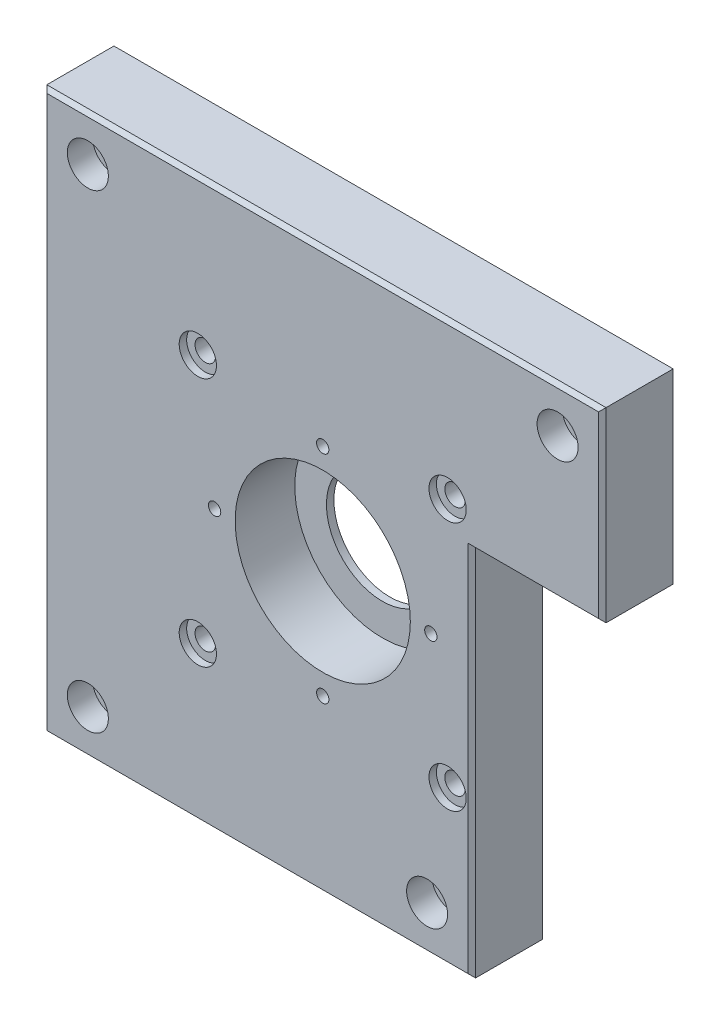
ISO-10303-21;
HEADER;
FILE_DESCRIPTION(('STEP AP214'),'2;1');
FILE_NAME('part.step','',(''),(''),'','','');
FILE_SCHEMA(('AUTOMOTIVE_DESIGN { 1 0 10303 214 1 1 1 1 }'));
ENDSEC;
DATA;
#1=APPLICATION_CONTEXT('core data for automotive mechanical design processes');
#2=APPLICATION_PROTOCOL_DEFINITION('international standard','automotive_design',2000,#1);
#3=PRODUCT_CONTEXT('',#1,'mechanical');
#4=PRODUCT('Part','Part','',(#3));
#5=PRODUCT_RELATED_PRODUCT_CATEGORY('part','',(#4));
#6=PRODUCT_DEFINITION_FORMATION('','',#4);
#7=PRODUCT_DEFINITION_CONTEXT('part definition',#1,'design');
#8=PRODUCT_DEFINITION('design','',#6,#7);
#9=PRODUCT_DEFINITION_SHAPE('','',#8);
#10=(LENGTH_UNIT() NAMED_UNIT(*) SI_UNIT(.MILLI.,.METRE.));
#11=(NAMED_UNIT(*) PLANE_ANGLE_UNIT() SI_UNIT($,.RADIAN.));
#12=(NAMED_UNIT(*) SI_UNIT($,.STERADIAN.) SOLID_ANGLE_UNIT());
#13=UNCERTAINTY_MEASURE_WITH_UNIT(LENGTH_MEASURE(1.E-05),#10,'distance_accuracy_value','');
#14=(GEOMETRIC_REPRESENTATION_CONTEXT(3) GLOBAL_UNCERTAINTY_ASSIGNED_CONTEXT((#13)) GLOBAL_UNIT_ASSIGNED_CONTEXT((#10,
#11,#12)) REPRESENTATION_CONTEXT('',''));
#15=CARTESIAN_POINT('',(0.,0.,0.));
#16=DIRECTION('',(0.,0.,1.));
#17=DIRECTION('',(1.,0.,0.));
#18=AXIS2_PLACEMENT_3D('',#15,#16,#17);
#19=CARTESIAN_POINT('',(0.,0.,2.));
#20=DIRECTION('',(0.,0.,-1.));
#21=DIRECTION('',(-1.,0.,0.));
#22=AXIS2_PLACEMENT_3D('',#19,#20,#21);
#23=CYLINDRICAL_SURFACE('',#22,20.5);
#24=CARTESIAN_POINT('',(0.,0.,2.));
#25=DIRECTION('',(0.,0.,-1.));
#26=DIRECTION('',(-1.,0.,0.));
#27=AXIS2_PLACEMENT_3D('',#24,#25,#26);
#28=CIRCLE('',#27,20.5);
#29=CARTESIAN_POINT('',(-20.5,0.,2.));
#30=VERTEX_POINT('',#29);
#31=EDGE_CURVE('E158',#30,#30,#28,.T.);
#32=ORIENTED_EDGE('',*,*,#31,.F.);
#33=EDGE_LOOP('',(#32));
#34=FACE_BOUND('',#33,.T.);
#35=CARTESIAN_POINT('',(0.,0.,1.));
#36=DIRECTION('',(0.,0.,-1.));
#37=DIRECTION('',(-1.,0.,0.));
#38=AXIS2_PLACEMENT_3D('',#35,#36,#37);
#39=CIRCLE('',#38,20.5);
#40=CARTESIAN_POINT('',(-20.5,0.,1.));
#41=VERTEX_POINT('',#40);
#42=EDGE_CURVE('E155',#41,#41,#39,.F.);
#43=ORIENTED_EDGE('',*,*,#42,.F.);
#44=EDGE_LOOP('',(#43));
#45=FACE_BOUND('',#44,.T.);
#46=ADVANCED_FACE('F16',(#34,#45),#23,.F.);
#47=CARTESIAN_POINT('',(0.,0.,-16.));
#48=DIRECTION('',(0.,0.,1.));
#49=DIRECTION('',(1.,0.,0.));
#50=AXIS2_PLACEMENT_3D('',#47,#48,#49);
#51=CYLINDRICAL_SURFACE('',#50,15.);
#52=CARTESIAN_POINT('',(0.,0.,4.));
#53=DIRECTION('',(0.,0.,1.));
#54=DIRECTION('',(1.,0.,0.));
#55=AXIS2_PLACEMENT_3D('',#52,#53,#54);
#56=CIRCLE('',#55,15.);
#57=CARTESIAN_POINT('',(15.,0.,4.));
#58=VERTEX_POINT('',#57);
#59=EDGE_CURVE('E278',#58,#58,#56,.T.);
#60=ORIENTED_EDGE('',*,*,#59,.T.);
#61=EDGE_LOOP('',(#60));
#62=FACE_BOUND('',#61,.T.);
#63=CARTESIAN_POINT('',(0.,0.,2.));
#64=DIRECTION('',(0.,0.,-1.));
#65=DIRECTION('',(-1.,0.,0.));
#66=AXIS2_PLACEMENT_3D('',#63,#64,#65);
#67=CIRCLE('',#66,15.);
#68=CARTESIAN_POINT('',(-15.,0.,2.));
#69=VERTEX_POINT('',#68);
#70=EDGE_CURVE('E161',#69,#69,#67,.F.);
#71=ORIENTED_EDGE('',*,*,#70,.F.);
#72=EDGE_LOOP('',(#71));
#73=FACE_BOUND('',#72,.T.);
#74=ADVANCED_FACE('F395',(#62,#73),#51,.F.);
#75=CARTESIAN_POINT('',(-33.5000000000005,-33.5000000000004,0.));
#76=DIRECTION('',(0.,0.,-1.));
#77=DIRECTION('',(-1.,0.,0.));
#78=AXIS2_PLACEMENT_3D('',#75,#76,#77);
#79=CYLINDRICAL_SURFACE('',#78,2.75);
#80=CARTESIAN_POINT('',(-33.5000000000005,-33.5000000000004,5.4));
#81=DIRECTION('',(0.,0.,-1.));
#82=DIRECTION('',(-1.,0.,0.));
#83=AXIS2_PLACEMENT_3D('',#80,#81,#82);
#84=CIRCLE('',#83,2.75);
#85=CARTESIAN_POINT('',(-36.2500000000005,-33.5000000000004,5.4));
#86=VERTEX_POINT('',#85);
#87=EDGE_CURVE('E262',#86,#86,#84,.T.);
#88=ORIENTED_EDGE('',*,*,#87,.T.);
#89=EDGE_LOOP('',(#88));
#90=FACE_BOUND('',#89,.T.);
#91=CARTESIAN_POINT('',(-33.5000000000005,-33.5000000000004,18.));
#92=DIRECTION('',(0.,0.,1.));
#93=DIRECTION('',(1.,0.,0.));
#94=AXIS2_PLACEMENT_3D('',#91,#92,#93);
#95=CIRCLE('',#94,2.75);
#96=CARTESIAN_POINT('',(-30.7500000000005,-33.5000000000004,18.));
#97=VERTEX_POINT('',#96);
#98=EDGE_CURVE('E214',#97,#97,#95,.F.);
#99=ORIENTED_EDGE('',*,*,#98,.F.);
#100=EDGE_LOOP('',(#99));
#101=FACE_BOUND('',#100,.T.);
#102=ADVANCED_FACE('F403',(#90,#101),#79,.F.);
#103=CARTESIAN_POINT('',(33.4999999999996,-33.5,0.));
#104=DIRECTION('',(0.,0.,-1.));
#105=DIRECTION('',(-1.,0.,0.));
#106=AXIS2_PLACEMENT_3D('',#103,#104,#105);
#107=CYLINDRICAL_SURFACE('',#106,2.75);
#108=CARTESIAN_POINT('',(33.4999999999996,-33.5,5.4));
#109=DIRECTION('',(0.,0.,-1.));
#110=DIRECTION('',(-1.,0.,0.));
#111=AXIS2_PLACEMENT_3D('',#108,#109,#110);
#112=CIRCLE('',#111,2.75);
#113=CARTESIAN_POINT('',(30.7499999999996,-33.5,5.4));
#114=VERTEX_POINT('',#113);
#115=EDGE_CURVE('E271',#114,#114,#112,.T.);
#116=ORIENTED_EDGE('',*,*,#115,.T.);
#117=EDGE_LOOP('',(#116));
#118=FACE_BOUND('',#117,.T.);
#119=CARTESIAN_POINT('',(33.4999999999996,-33.5,18.));
#120=DIRECTION('',(0.,0.,1.));
#121=DIRECTION('',(1.,0.,0.));
#122=AXIS2_PLACEMENT_3D('',#119,#120,#121);
#123=CIRCLE('',#122,2.75);
#124=CARTESIAN_POINT('',(36.2499999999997,-33.5,18.));
#125=VERTEX_POINT('',#124);
#126=EDGE_CURVE('E220',#125,#125,#123,.F.);
#127=ORIENTED_EDGE('',*,*,#126,.F.);
#128=EDGE_LOOP('',(#127));
#129=FACE_BOUND('',#128,.T.);
#130=ADVANCED_FACE('F504',(#118,#129),#107,.F.);
#131=CARTESIAN_POINT('',(33.4999999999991,33.5,0.));
#132=DIRECTION('',(0.,0.,-1.));
#133=DIRECTION('',(-1.,0.,0.));
#134=AXIS2_PLACEMENT_3D('',#131,#132,#133);
#135=CYLINDRICAL_SURFACE('',#134,2.75);
#136=CARTESIAN_POINT('',(33.4999999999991,33.5,5.4));
#137=DIRECTION('',(0.,0.,-1.));
#138=DIRECTION('',(-1.,0.,0.));
#139=AXIS2_PLACEMENT_3D('',#136,#137,#138);
#140=CIRCLE('',#139,2.75);
#141=CARTESIAN_POINT('',(30.7499999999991,33.5,5.4));
#142=VERTEX_POINT('',#141);
#143=EDGE_CURVE('E244',#142,#142,#140,.T.);
#144=ORIENTED_EDGE('',*,*,#143,.T.);
#145=EDGE_LOOP('',(#144));
#146=FACE_BOUND('',#145,.T.);
#147=CARTESIAN_POINT('',(33.4999999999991,33.5,18.));
#148=DIRECTION('',(0.,0.,1.));
#149=DIRECTION('',(1.,0.,0.));
#150=AXIS2_PLACEMENT_3D('',#147,#148,#149);
#151=CIRCLE('',#150,2.75);
#152=CARTESIAN_POINT('',(36.2499999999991,33.5,18.));
#153=VERTEX_POINT('',#152);
#154=EDGE_CURVE('E227',#153,#153,#151,.F.);
#155=ORIENTED_EDGE('',*,*,#154,.F.);
#156=EDGE_LOOP('',(#155));
#157=FACE_BOUND('',#156,.T.);
#158=ADVANCED_FACE('F500',(#146,#157),#135,.F.);
#159=CARTESIAN_POINT('',(-33.5000000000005,33.5,0.));
#160=DIRECTION('',(0.,0.,-1.));
#161=DIRECTION('',(-1.,0.,0.));
#162=AXIS2_PLACEMENT_3D('',#159,#160,#161);
#163=CYLINDRICAL_SURFACE('',#162,2.75);
#164=CARTESIAN_POINT('',(-33.5000000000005,33.5,5.4));
#165=DIRECTION('',(0.,0.,-1.));
#166=DIRECTION('',(-1.,0.,0.));
#167=AXIS2_PLACEMENT_3D('',#164,#165,#166);
#168=CIRCLE('',#167,2.75);
#169=CARTESIAN_POINT('',(-36.2500000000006,33.5,5.4));
#170=VERTEX_POINT('',#169);
#171=EDGE_CURVE('E253',#170,#170,#168,.T.);
#172=ORIENTED_EDGE('',*,*,#171,.T.);
#173=EDGE_LOOP('',(#172));
#174=FACE_BOUND('',#173,.T.);
#175=CARTESIAN_POINT('',(-33.5000000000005,33.5,18.));
#176=DIRECTION('',(0.,0.,1.));
#177=DIRECTION('',(1.,0.,0.));
#178=AXIS2_PLACEMENT_3D('',#175,#176,#177);
#179=CIRCLE('',#178,2.75);
#180=CARTESIAN_POINT('',(-30.7500000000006,33.5,18.));
#181=VERTEX_POINT('',#180);
#182=EDGE_CURVE('E234',#181,#181,#179,.F.);
#183=ORIENTED_EDGE('',*,*,#182,.F.);
#184=EDGE_LOOP('',(#183));
#185=FACE_BOUND('',#184,.T.);
#186=ADVANCED_FACE('F503',(#174,#185),#163,.F.);
#187=CARTESIAN_POINT('',(75.,75.,20.));
#188=DIRECTION('',(-1.,0.,0.));
#189=DIRECTION('',(0.,-1.,0.));
#190=AXIS2_PLACEMENT_3D('',#187,#188,#189);
#191=PLANE('',#190);
#192=DIRECTION('',(0.,0.,-1.));
#193=VECTOR('',#192,1.);
#194=CARTESIAN_POINT('',(75.,25.,20.));
#195=LINE('',#194,#193);
#196=CARTESIAN_POINT('',(75.,25.,19.));
#197=VERTEX_POINT('',#196);
#198=CARTESIAN_POINT('',(75.,25.,0.999999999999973));
#199=VERTEX_POINT('',#198);
#200=EDGE_CURVE('E275',#197,#199,#195,.T.);
#201=ORIENTED_EDGE('',*,*,#200,.T.);
#202=DIRECTION('',(0.,1.,0.));
#203=VECTOR('',#202,1.);
#204=CARTESIAN_POINT('',(75.,75.,0.999999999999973));
#205=LINE('',#204,#203);
#206=CARTESIAN_POINT('',(75.,75.,0.999999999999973));
#207=VERTEX_POINT('',#206);
#208=EDGE_CURVE('E340',#199,#207,#205,.T.);
#209=ORIENTED_EDGE('',*,*,#208,.T.);
#210=DIRECTION('',(0.,0.,-1.));
#211=VECTOR('',#210,1.);
#212=CARTESIAN_POINT('',(75.,75.,20.));
#213=LINE('',#212,#211);
#214=CARTESIAN_POINT('',(75.,75.,19.));
#215=VERTEX_POINT('',#214);
#216=EDGE_CURVE('E300',#215,#207,#213,.T.);
#217=ORIENTED_EDGE('',*,*,#216,.F.);
#218=DIRECTION('',(0.,-1.,0.));
#219=VECTOR('',#218,1.);
#220=CARTESIAN_POINT('',(75.,25.,19.));
#221=LINE('',#220,#219);
#222=EDGE_CURVE('E338',#215,#197,#221,.T.);
#223=ORIENTED_EDGE('',*,*,#222,.T.);
#224=EDGE_LOOP('',(#201,#209,#217,#223));
#225=FACE_BOUND('',#224,.T.);
#226=ADVANCED_FACE('F516',(#225),#191,.F.);
#227=CARTESIAN_POINT('',(-75.,75.,20.));
#228=DIRECTION('',(0.,-1.,0.));
#229=DIRECTION('',(0.,0.,-1.));
#230=AXIS2_PLACEMENT_3D('',#227,#228,#229);
#231=PLANE('',#230);
#232=ORIENTED_EDGE('',*,*,#216,.T.);
#233=DIRECTION('',(-1.,0.,0.));
#234=VECTOR('',#233,1.);
#235=CARTESIAN_POINT('',(-75.,75.,0.999999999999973));
#236=LINE('',#235,#234);
#237=CARTESIAN_POINT('',(-75.,75.,0.999999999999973));
#238=VERTEX_POINT('',#237);
#239=EDGE_CURVE('E305',#207,#238,#236,.T.);
#240=ORIENTED_EDGE('',*,*,#239,.T.);
#241=DIRECTION('',(0.,0.,-1.));
#242=VECTOR('',#241,1.);
#243=CARTESIAN_POINT('',(-75.,75.,20.));
#244=LINE('',#243,#242);
#245=CARTESIAN_POINT('',(-75.,75.,19.));
#246=VERTEX_POINT('',#245);
#247=EDGE_CURVE('E297',#246,#238,#244,.T.);
#248=ORIENTED_EDGE('',*,*,#247,.F.);
#249=DIRECTION('',(1.,0.,0.));
#250=VECTOR('',#249,1.);
#251=CARTESIAN_POINT('',(75.,75.,19.));
#252=LINE('',#251,#250);
#253=EDGE_CURVE('E303',#246,#215,#252,.T.);
#254=ORIENTED_EDGE('',*,*,#253,.T.);
#255=EDGE_LOOP('',(#232,#240,#248,#254));
#256=FACE_BOUND('',#255,.T.);
#257=ADVANCED_FACE('F572',(#256),#231,.F.);
#258=CARTESIAN_POINT('',(-75.,75.,20.));
#259=DIRECTION('',(1.,0.,0.));
#260=DIRECTION('',(0.,1.,0.));
#261=AXIS2_PLACEMENT_3D('',#258,#259,#260);
#262=PLANE('',#261);
#263=CARTESIAN_POINT('',(-75.,-1.00000000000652,10.));
#264=DIRECTION('',(-1.,0.,0.));
#265=DIRECTION('',(0.,0.,1.));
#266=AXIS2_PLACEMENT_3D('',#263,#264,#265);
#267=CIRCLE('',#266,1.25);
#268=CARTESIAN_POINT('',(-75.,-1.00000000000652,11.25));
#269=VERTEX_POINT('',#268);
#270=EDGE_CURVE('E120',#269,#269,#267,.T.);
#271=ORIENTED_EDGE('',*,*,#270,.F.);
#272=EDGE_LOOP('',(#271));
#273=FACE_BOUND('',#272,.T.);
#274=CARTESIAN_POINT('',(-75.,-17.0000000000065,10.));
#275=DIRECTION('',(-1.,0.,0.));
#276=DIRECTION('',(0.,0.,1.));
#277=AXIS2_PLACEMENT_3D('',#274,#275,#276);
#278=CIRCLE('',#277,1.24999999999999);
#279=CARTESIAN_POINT('',(-75.,-17.0000000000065,11.25));
#280=VERTEX_POINT('',#279);
#281=EDGE_CURVE('E119',#280,#280,#278,.T.);
#282=ORIENTED_EDGE('',*,*,#281,.F.);
#283=EDGE_LOOP('',(#282));
#284=FACE_BOUND('',#283,.T.);
#285=ORIENTED_EDGE('',*,*,#247,.T.);
#286=DIRECTION('',(0.,-1.,0.));
#287=VECTOR('',#286,1.);
#288=CARTESIAN_POINT('',(-75.,75.,0.999999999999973));
#289=LINE('',#288,#287);
#290=CARTESIAN_POINT('',(-75.,-75.,0.999999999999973));
#291=VERTEX_POINT('',#290);
#292=EDGE_CURVE('E323',#238,#291,#289,.T.);
#293=ORIENTED_EDGE('',*,*,#292,.T.);
#294=DIRECTION('',(0.,0.,-1.));
#295=VECTOR('',#294,1.);
#296=CARTESIAN_POINT('',(-75.,-75.,20.));
#297=LINE('',#296,#295);
#298=CARTESIAN_POINT('',(-75.,-75.,19.));
#299=VERTEX_POINT('',#298);
#300=EDGE_CURVE('E292',#299,#291,#297,.T.);
#301=ORIENTED_EDGE('',*,*,#300,.F.);
#302=DIRECTION('',(0.,1.,0.));
#303=VECTOR('',#302,1.);
#304=CARTESIAN_POINT('',(-75.,75.,19.));
#305=LINE('',#304,#303);
#306=EDGE_CURVE('E321',#299,#246,#305,.T.);
#307=ORIENTED_EDGE('',*,*,#306,.T.);
#308=EDGE_LOOP('',(#285,#293,#301,#307));
#309=FACE_BOUND('',#308,.T.);
#310=ADVANCED_FACE('F568',(#273,#284,#309),#262,.F.);
#311=CARTESIAN_POINT('',(-75.,-75.,20.));
#312=DIRECTION('',(0.,1.,0.));
#313=DIRECTION('',(-1.,0.,0.));
#314=AXIS2_PLACEMENT_3D('',#311,#312,#313);
#315=PLANE('',#314);
#316=ORIENTED_EDGE('',*,*,#300,.T.);
#317=DIRECTION('',(1.,0.,0.));
#318=VECTOR('',#317,1.);
#319=CARTESIAN_POINT('',(-75.,-75.,0.999999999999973));
#320=LINE('',#319,#318);
#321=CARTESIAN_POINT('',(40.,-75.,0.999999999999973));
#322=VERTEX_POINT('',#321);
#323=EDGE_CURVE('E327',#291,#322,#320,.T.);
#324=ORIENTED_EDGE('',*,*,#323,.T.);
#325=DIRECTION('',(0.,0.,-1.));
#326=VECTOR('',#325,1.);
#327=CARTESIAN_POINT('',(40.,-75.,20.));
#328=LINE('',#327,#326);
#329=CARTESIAN_POINT('',(40.,-75.,19.));
#330=VERTEX_POINT('',#329);
#331=EDGE_CURVE('E282',#330,#322,#328,.T.);
#332=ORIENTED_EDGE('',*,*,#331,.F.);
#333=DIRECTION('',(-1.,0.,0.));
#334=VECTOR('',#333,1.);
#335=CARTESIAN_POINT('',(-75.,-75.,19.));
#336=LINE('',#335,#334);
#337=EDGE_CURVE('E325',#330,#299,#336,.T.);
#338=ORIENTED_EDGE('',*,*,#337,.T.);
#339=EDGE_LOOP('',(#316,#324,#332,#338));
#340=FACE_BOUND('',#339,.T.);
#341=ADVANCED_FACE('F561',(#340),#315,.F.);
#342=CARTESIAN_POINT('',(0.,0.,20.));
#343=DIRECTION('',(0.,0.,1.));
#344=DIRECTION('',(1.,0.,0.));
#345=AXIS2_PLACEMENT_3D('',#342,#343,#344);
#346=PLANE('',#345);
#347=CARTESIAN_POINT('',(0.,29.,20.));
#348=DIRECTION('',(0.,0.,1.));
#349=DIRECTION('',(1.,0.,0.));
#350=AXIS2_PLACEMENT_3D('',#347,#348,#349);
#351=CIRCLE('',#350,1.65);
#352=CARTESIAN_POINT('',(1.65,29.,20.));
#353=VERTEX_POINT('',#352);
#354=EDGE_CURVE('E130',#353,#353,#351,.T.);
#355=ORIENTED_EDGE('',*,*,#354,.F.);
#356=EDGE_LOOP('',(#355));
#357=FACE_BOUND('',#356,.T.);
#358=CARTESIAN_POINT('',(29.0000000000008,8.20678097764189E-13,20.));
#359=DIRECTION('',(0.,0.,1.));
#360=DIRECTION('',(1.,0.,0.));
#361=AXIS2_PLACEMENT_3D('',#358,#359,#360);
#362=CIRCLE('',#361,1.65);
#363=CARTESIAN_POINT('',(30.6500000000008,8.20678097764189E-13,20.));
#364=VERTEX_POINT('',#363);
#365=EDGE_CURVE('E133',#364,#364,#362,.T.);
#366=ORIENTED_EDGE('',*,*,#365,.F.);
#367=EDGE_LOOP('',(#366));
#368=FACE_BOUND('',#367,.T.);
#369=CARTESIAN_POINT('',(1.64135619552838E-12,-29.,20.));
#370=DIRECTION('',(0.,0.,1.));
#371=DIRECTION('',(1.,0.,0.));
#372=AXIS2_PLACEMENT_3D('',#369,#370,#371);
#373=CIRCLE('',#372,1.65);
#374=CARTESIAN_POINT('',(1.65000000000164,-29.,20.));
#375=VERTEX_POINT('',#374);
#376=EDGE_CURVE('E139',#375,#375,#373,.T.);
#377=ORIENTED_EDGE('',*,*,#376,.F.);
#378=EDGE_LOOP('',(#377));
#379=FACE_BOUND('',#378,.T.);
#380=CARTESIAN_POINT('',(-28.9999999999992,-8.17126622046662E-13,20.));
#381=DIRECTION('',(0.,0.,1.));
#382=DIRECTION('',(1.,0.,0.));
#383=AXIS2_PLACEMENT_3D('',#380,#381,#382);
#384=CIRCLE('',#383,1.65);
#385=CARTESIAN_POINT('',(-27.3499999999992,-8.17126622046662E-13,20.));
#386=VERTEX_POINT('',#385);
#387=EDGE_CURVE('E145',#386,#386,#384,.T.);
#388=ORIENTED_EDGE('',*,*,#387,.F.);
#389=EDGE_LOOP('',(#388));
#390=FACE_BOUND('',#389,.T.);
#391=CARTESIAN_POINT('',(63.,63.,20.));
#392=DIRECTION('',(0.,0.,1.));
#393=DIRECTION('',(1.,0.,0.));
#394=AXIS2_PLACEMENT_3D('',#391,#392,#393);
#395=CIRCLE('',#394,5.5);
#396=CARTESIAN_POINT('',(68.5,63.,20.));
#397=VERTEX_POINT('',#396);
#398=EDGE_CURVE('E162',#397,#397,#395,.T.);
#399=ORIENTED_EDGE('',*,*,#398,.F.);
#400=EDGE_LOOP('',(#399));
#401=FACE_BOUND('',#400,.T.);
#402=CARTESIAN_POINT('',(-63.,63.,20.));
#403=DIRECTION('',(0.,0.,1.));
#404=DIRECTION('',(1.,0.,0.));
#405=AXIS2_PLACEMENT_3D('',#402,#403,#404);
#406=CIRCLE('',#405,5.5);
#407=CARTESIAN_POINT('',(-57.5,63.,20.));
#408=VERTEX_POINT('',#407);
#409=EDGE_CURVE('E174',#408,#408,#406,.T.);
#410=ORIENTED_EDGE('',*,*,#409,.F.);
#411=EDGE_LOOP('',(#410));
#412=FACE_BOUND('',#411,.T.);
#413=CARTESIAN_POINT('',(-63.,-63.,20.));
#414=DIRECTION('',(0.,0.,1.));
#415=DIRECTION('',(1.,0.,0.));
#416=AXIS2_PLACEMENT_3D('',#413,#414,#415);
#417=CIRCLE('',#416,5.5);
#418=CARTESIAN_POINT('',(-57.5,-63.,20.));
#419=VERTEX_POINT('',#418);
#420=EDGE_CURVE('E186',#419,#419,#417,.T.);
#421=ORIENTED_EDGE('',*,*,#420,.F.);
#422=EDGE_LOOP('',(#421));
#423=FACE_BOUND('',#422,.T.);
#424=CARTESIAN_POINT('',(28.,-63.,20.));
#425=DIRECTION('',(0.,0.,1.));
#426=DIRECTION('',(1.,0.,0.));
#427=AXIS2_PLACEMENT_3D('',#424,#425,#426);
#428=CIRCLE('',#427,5.5);
#429=CARTESIAN_POINT('',(33.5,-63.,20.));
#430=VERTEX_POINT('',#429);
#431=EDGE_CURVE('E198',#430,#430,#428,.T.);
#432=ORIENTED_EDGE('',*,*,#431,.F.);
#433=EDGE_LOOP('',(#432));
#434=FACE_BOUND('',#433,.T.);
#435=CARTESIAN_POINT('',(-33.5000000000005,-33.5000000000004,20.));
#436=DIRECTION('',(0.,0.,1.));
#437=DIRECTION('',(1.,0.,0.));
#438=AXIS2_PLACEMENT_3D('',#435,#436,#437);
#439=CIRCLE('',#438,5.);
#440=CARTESIAN_POINT('',(-28.5000000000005,-33.5000000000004,20.));
#441=VERTEX_POINT('',#440);
#442=EDGE_CURVE('E210',#441,#441,#439,.T.);
#443=ORIENTED_EDGE('',*,*,#442,.F.);
#444=EDGE_LOOP('',(#443));
#445=FACE_BOUND('',#444,.T.);
#446=CARTESIAN_POINT('',(33.4999999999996,-33.5,20.));
#447=DIRECTION('',(0.,0.,1.));
#448=DIRECTION('',(1.,0.,0.));
#449=AXIS2_PLACEMENT_3D('',#446,#447,#448);
#450=CIRCLE('',#449,5.);
#451=CARTESIAN_POINT('',(38.4999999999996,-33.5,20.));
#452=VERTEX_POINT('',#451);
#453=EDGE_CURVE('E221',#452,#452,#450,.T.);
#454=ORIENTED_EDGE('',*,*,#453,.F.);
#455=EDGE_LOOP('',(#454));
#456=FACE_BOUND('',#455,.T.);
#457=CARTESIAN_POINT('',(33.4999999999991,33.5,20.));
#458=DIRECTION('',(0.,0.,1.));
#459=DIRECTION('',(1.,0.,0.));
#460=AXIS2_PLACEMENT_3D('',#457,#458,#459);
#461=CIRCLE('',#460,5.);
#462=CARTESIAN_POINT('',(38.4999999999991,33.5,20.));
#463=VERTEX_POINT('',#462);
#464=EDGE_CURVE('E228',#463,#463,#461,.T.);
#465=ORIENTED_EDGE('',*,*,#464,.F.);
#466=EDGE_LOOP('',(#465));
#467=FACE_BOUND('',#466,.T.);
#468=CARTESIAN_POINT('',(-33.5000000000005,33.5,20.));
#469=DIRECTION('',(0.,0.,1.));
#470=DIRECTION('',(1.,0.,0.));
#471=AXIS2_PLACEMENT_3D('',#468,#469,#470);
#472=CIRCLE('',#471,5.);
#473=CARTESIAN_POINT('',(-28.5000000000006,33.5,20.));
#474=VERTEX_POINT('',#473);
#475=EDGE_CURVE('E235',#474,#474,#472,.T.);
#476=ORIENTED_EDGE('',*,*,#475,.F.);
#477=EDGE_LOOP('',(#476));
#478=FACE_BOUND('',#477,.T.);
#479=DIRECTION('',(1.,0.,0.));
#480=VECTOR('',#479,1.);
#481=CARTESIAN_POINT('',(40.,-74.,20.));
#482=LINE('',#481,#480);
#483=CARTESIAN_POINT('',(-74.,-74.,20.));
#484=VERTEX_POINT('',#483);
#485=CARTESIAN_POINT('',(39.,-74.,20.));
#486=VERTEX_POINT('',#485);
#487=EDGE_CURVE('E25',#484,#486,#482,.T.);
#488=ORIENTED_EDGE('',*,*,#487,.T.);
#489=DIRECTION('',(0.,1.,0.));
#490=VECTOR('',#489,1.);
#491=CARTESIAN_POINT('',(39.,25.,20.));
#492=LINE('',#491,#490);
#493=CARTESIAN_POINT('',(39.,26.,20.));
#494=VERTEX_POINT('',#493);
#495=EDGE_CURVE('E11',#486,#494,#492,.T.);
#496=ORIENTED_EDGE('',*,*,#495,.T.);
#497=DIRECTION('',(1.,0.,0.));
#498=VECTOR('',#497,1.);
#499=CARTESIAN_POINT('',(75.,26.,20.));
#500=LINE('',#499,#498);
#501=CARTESIAN_POINT('',(74.,26.,20.));
#502=VERTEX_POINT('',#501);
#503=EDGE_CURVE('E342',#494,#502,#500,.T.);
#504=ORIENTED_EDGE('',*,*,#503,.T.);
#505=DIRECTION('',(0.,1.,0.));
#506=VECTOR('',#505,1.);
#507=CARTESIAN_POINT('',(74.,75.,20.));
#508=LINE('',#507,#506);
#509=CARTESIAN_POINT('',(74.,74.,20.));
#510=VERTEX_POINT('',#509);
#511=EDGE_CURVE('E344',#502,#510,#508,.T.);
#512=ORIENTED_EDGE('',*,*,#511,.T.);
#513=DIRECTION('',(-1.,0.,0.));
#514=VECTOR('',#513,1.);
#515=CARTESIAN_POINT('',(-75.,74.,20.));
#516=LINE('',#515,#514);
#517=CARTESIAN_POINT('',(-74.,74.,20.));
#518=VERTEX_POINT('',#517);
#519=EDGE_CURVE('E346',#510,#518,#516,.T.);
#520=ORIENTED_EDGE('',*,*,#519,.T.);
#521=DIRECTION('',(0.,-1.,0.));
#522=VECTOR('',#521,1.);
#523=CARTESIAN_POINT('',(-74.,-75.,20.));
#524=LINE('',#523,#522);
#525=EDGE_CURVE('E36',#518,#484,#524,.T.);
#526=ORIENTED_EDGE('',*,*,#525,.T.);
#527=EDGE_LOOP('',(#488,#496,#504,#512,#520,#526));
#528=FACE_BOUND('',#527,.T.);
#529=CARTESIAN_POINT('',(0.,0.,20.));
#530=DIRECTION('',(0.,0.,1.));
#531=DIRECTION('',(1.,0.,0.));
#532=AXIS2_PLACEMENT_3D('',#529,#530,#531);
#533=CIRCLE('',#532,23.5);
#534=CARTESIAN_POINT('',(23.5,0.,20.));
#535=VERTEX_POINT('',#534);
#536=EDGE_CURVE('E288',#535,#535,#533,.T.);
#537=ORIENTED_EDGE('',*,*,#536,.F.);
#538=EDGE_LOOP('',(#537));
#539=FACE_BOUND('',#538,.T.);
#540=ADVANCED_FACE('F558',(#357,#368,#379,#390,#401,#412,#423,#434,#445,#456,#467,#478,#528,
#539),#346,.T.);
#541=CARTESIAN_POINT('',(0.,0.,0.));
#542=DIRECTION('',(0.,0.,1.));
#543=DIRECTION('',(1.,0.,0.));
#544=AXIS2_PLACEMENT_3D('',#541,#542,#543);
#545=PLANE('',#544);
#546=CARTESIAN_POINT('',(0.,0.,0.));
#547=DIRECTION('',(0.,0.,-1.));
#548=DIRECTION('',(-1.,0.,0.));
#549=AXIS2_PLACEMENT_3D('',#546,#547,#548);
#550=CIRCLE('',#549,31.);
#551=CARTESIAN_POINT('',(-31.,0.,0.));
#552=VERTEX_POINT('',#551);
#553=EDGE_CURVE('E151',#552,#552,#550,.T.);
#554=ORIENTED_EDGE('',*,*,#553,.F.);
#555=EDGE_LOOP('',(#554));
#556=FACE_BOUND('',#555,.T.);
#557=CARTESIAN_POINT('',(63.,63.,0.));
#558=DIRECTION('',(0.,0.,1.));
#559=DIRECTION('',(1.,0.,0.));
#560=AXIS2_PLACEMENT_3D('',#557,#558,#559);
#561=CIRCLE('',#560,3.3);
#562=CARTESIAN_POINT('',(66.3,63.,0.));
#563=VERTEX_POINT('',#562);
#564=EDGE_CURVE('E171',#563,#563,#561,.T.);
#565=ORIENTED_EDGE('',*,*,#564,.T.);
#566=EDGE_LOOP('',(#565));
#567=FACE_BOUND('',#566,.T.);
#568=CARTESIAN_POINT('',(-63.,63.,0.));
#569=DIRECTION('',(0.,0.,1.));
#570=DIRECTION('',(1.,0.,0.));
#571=AXIS2_PLACEMENT_3D('',#568,#569,#570);
#572=CIRCLE('',#571,3.3);
#573=CARTESIAN_POINT('',(-59.7,63.,0.));
#574=VERTEX_POINT('',#573);
#575=EDGE_CURVE('E183',#574,#574,#572,.T.);
#576=ORIENTED_EDGE('',*,*,#575,.T.);
#577=EDGE_LOOP('',(#576));
#578=FACE_BOUND('',#577,.T.);
#579=CARTESIAN_POINT('',(-63.,-63.,0.));
#580=DIRECTION('',(0.,0.,1.));
#581=DIRECTION('',(1.,0.,0.));
#582=AXIS2_PLACEMENT_3D('',#579,#580,#581);
#583=CIRCLE('',#582,3.3);
#584=CARTESIAN_POINT('',(-59.7,-63.,0.));
#585=VERTEX_POINT('',#584);
#586=EDGE_CURVE('E195',#585,#585,#583,.T.);
#587=ORIENTED_EDGE('',*,*,#586,.T.);
#588=EDGE_LOOP('',(#587));
#589=FACE_BOUND('',#588,.T.);
#590=CARTESIAN_POINT('',(28.,-63.,0.));
#591=DIRECTION('',(0.,0.,1.));
#592=DIRECTION('',(1.,0.,0.));
#593=AXIS2_PLACEMENT_3D('',#590,#591,#592);
#594=CIRCLE('',#593,3.3);
#595=CARTESIAN_POINT('',(31.3,-63.,0.));
#596=VERTEX_POINT('',#595);
#597=EDGE_CURVE('E207',#596,#596,#594,.T.);
#598=ORIENTED_EDGE('',*,*,#597,.T.);
#599=EDGE_LOOP('',(#598));
#600=FACE_BOUND('',#599,.T.);
#601=CARTESIAN_POINT('',(33.4999999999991,33.5,0.));
#602=DIRECTION('',(0.,0.,-1.));
#603=DIRECTION('',(-1.,0.,0.));
#604=AXIS2_PLACEMENT_3D('',#601,#602,#603);
#605=CIRCLE('',#604,5.);
#606=CARTESIAN_POINT('',(28.4999999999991,33.5,0.));
#607=VERTEX_POINT('',#606);
#608=EDGE_CURVE('E238',#607,#607,#605,.T.);
#609=ORIENTED_EDGE('',*,*,#608,.F.);
#610=EDGE_LOOP('',(#609));
#611=FACE_BOUND('',#610,.T.);
#612=CARTESIAN_POINT('',(-33.5000000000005,33.5,0.));
#613=DIRECTION('',(0.,0.,-1.));
#614=DIRECTION('',(-1.,0.,0.));
#615=AXIS2_PLACEMENT_3D('',#612,#613,#614);
#616=CIRCLE('',#615,5.);
#617=CARTESIAN_POINT('',(-38.5000000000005,33.5,0.));
#618=VERTEX_POINT('',#617);
#619=EDGE_CURVE('E247',#618,#618,#616,.T.);
#620=ORIENTED_EDGE('',*,*,#619,.F.);
#621=EDGE_LOOP('',(#620));
#622=FACE_BOUND('',#621,.T.);
#623=CARTESIAN_POINT('',(-33.5000000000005,-33.5000000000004,0.));
#624=DIRECTION('',(0.,0.,-1.));
#625=DIRECTION('',(-1.,0.,0.));
#626=AXIS2_PLACEMENT_3D('',#623,#624,#625);
#627=CIRCLE('',#626,5.);
#628=CARTESIAN_POINT('',(-38.5000000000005,-33.5000000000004,0.));
#629=VERTEX_POINT('',#628);
#630=EDGE_CURVE('E256',#629,#629,#627,.T.);
#631=ORIENTED_EDGE('',*,*,#630,.F.);
#632=EDGE_LOOP('',(#631));
#633=FACE_BOUND('',#632,.T.);
#634=CARTESIAN_POINT('',(33.4999999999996,-33.5,0.));
#635=DIRECTION('',(0.,0.,-1.));
#636=DIRECTION('',(-1.,0.,0.));
#637=AXIS2_PLACEMENT_3D('',#634,#635,#636);
#638=CIRCLE('',#637,5.);
#639=CARTESIAN_POINT('',(28.4999999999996,-33.5,0.));
#640=VERTEX_POINT('',#639);
#641=EDGE_CURVE('E265',#640,#640,#638,.T.);
#642=ORIENTED_EDGE('',*,*,#641,.F.);
#643=EDGE_LOOP('',(#642));
#644=FACE_BOUND('',#643,.T.);
#645=DIRECTION('',(0.,1.,0.));
#646=VECTOR('',#645,1.);
#647=CARTESIAN_POINT('',(-74.,0.,0.));
#648=LINE('',#647,#646);
#649=CARTESIAN_POINT('',(-74.,-74.,0.));
#650=VERTEX_POINT('',#649);
#651=CARTESIAN_POINT('',(-74.,74.,0.));
#652=VERTEX_POINT('',#651);
#653=EDGE_CURVE('E316',#650,#652,#648,.T.);
#654=ORIENTED_EDGE('',*,*,#653,.T.);
#655=DIRECTION('',(1.,0.,0.));
#656=VECTOR('',#655,1.);
#657=CARTESIAN_POINT('',(0.,74.,0.));
#658=LINE('',#657,#656);
#659=CARTESIAN_POINT('',(74.,74.,0.));
#660=VERTEX_POINT('',#659);
#661=EDGE_CURVE('E318',#652,#660,#658,.T.);
#662=ORIENTED_EDGE('',*,*,#661,.T.);
#663=DIRECTION('',(0.,-1.,0.));
#664=VECTOR('',#663,1.);
#665=CARTESIAN_POINT('',(74.,0.,0.));
#666=LINE('',#665,#664);
#667=CARTESIAN_POINT('',(74.,26.,0.));
#668=VERTEX_POINT('',#667);
#669=EDGE_CURVE('E308',#660,#668,#666,.T.);
#670=ORIENTED_EDGE('',*,*,#669,.T.);
#671=DIRECTION('',(-1.,0.,0.));
#672=VECTOR('',#671,1.);
#673=CARTESIAN_POINT('',(0.,26.,0.));
#674=LINE('',#673,#672);
#675=CARTESIAN_POINT('',(39.,26.,0.));
#676=VERTEX_POINT('',#675);
#677=EDGE_CURVE('E310',#668,#676,#674,.T.);
#678=ORIENTED_EDGE('',*,*,#677,.T.);
#679=DIRECTION('',(0.,-1.,0.));
#680=VECTOR('',#679,1.);
#681=CARTESIAN_POINT('',(39.,0.,0.));
#682=LINE('',#681,#680);
#683=CARTESIAN_POINT('',(39.,-74.,0.));
#684=VERTEX_POINT('',#683);
#685=EDGE_CURVE('E312',#676,#684,#682,.T.);
#686=ORIENTED_EDGE('',*,*,#685,.T.);
#687=DIRECTION('',(-1.,0.,0.));
#688=VECTOR('',#687,1.);
#689=CARTESIAN_POINT('',(0.,-74.,0.));
#690=LINE('',#689,#688);
#691=EDGE_CURVE('E314',#684,#650,#690,.T.);
#692=ORIENTED_EDGE('',*,*,#691,.T.);
#693=EDGE_LOOP('',(#654,#662,#670,#678,#686,#692));
#694=FACE_BOUND('',#693,.T.);
#695=ADVANCED_FACE('F556',(#556,#567,#578,#589,#600,#611,#622,#633,#644,#694),#545,.F.);
#696=CARTESIAN_POINT('',(0.,0.,4.));
#697=DIRECTION('',(0.,0.,1.));
#698=DIRECTION('',(1.,0.,0.));
#699=AXIS2_PLACEMENT_3D('',#696,#697,#698);
#700=CYLINDRICAL_SURFACE('',#699,23.5);
#701=CARTESIAN_POINT('',(0.,0.,4.));
#702=DIRECTION('',(0.,0.,1.));
#703=DIRECTION('',(1.,0.,0.));
#704=AXIS2_PLACEMENT_3D('',#701,#702,#703);
#705=CIRCLE('',#704,23.5);
#706=CARTESIAN_POINT('',(23.5,0.,4.));
#707=VERTEX_POINT('',#706);
#708=EDGE_CURVE('E289',#707,#707,#705,.T.);
#709=ORIENTED_EDGE('',*,*,#708,.F.);
#710=EDGE_LOOP('',(#709));
#711=FACE_BOUND('',#710,.T.);
#712=ORIENTED_EDGE('',*,*,#536,.T.);
#713=EDGE_LOOP('',(#712));
#714=FACE_BOUND('',#713,.T.);
#715=ADVANCED_FACE('F552',(#711,#714),#700,.F.);
#716=CARTESIAN_POINT('',(0.,0.,4.));
#717=DIRECTION('',(0.,0.,1.));
#718=DIRECTION('',(1.,0.,0.));
#719=AXIS2_PLACEMENT_3D('',#716,#717,#718);
#720=PLANE('',#719);
#721=ORIENTED_EDGE('',*,*,#59,.F.);
#722=EDGE_LOOP('',(#721));
#723=FACE_BOUND('',#722,.T.);
#724=ORIENTED_EDGE('',*,*,#708,.T.);
#725=EDGE_LOOP('',(#724));
#726=FACE_BOUND('',#725,.T.);
#727=ADVANCED_FACE('F544',(#723,#726),#720,.T.);
#728=CARTESIAN_POINT('',(75.,25.,20.));
#729=DIRECTION('',(0.,1.,0.));
#730=DIRECTION('',(0.,0.,1.));
#731=AXIS2_PLACEMENT_3D('',#728,#729,#730);
#732=PLANE('',#731);
#733=DIRECTION('',(0.,0.,-1.));
#734=VECTOR('',#733,1.);
#735=CARTESIAN_POINT('',(40.,25.,20.));
#736=LINE('',#735,#734);
#737=CARTESIAN_POINT('',(40.,25.,19.));
#738=VERTEX_POINT('',#737);
#739=CARTESIAN_POINT('',(40.,25.,0.999999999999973));
#740=VERTEX_POINT('',#739);
#741=EDGE_CURVE('E279',#738,#740,#736,.T.);
#742=ORIENTED_EDGE('',*,*,#741,.T.);
#743=DIRECTION('',(1.,0.,0.));
#744=VECTOR('',#743,1.);
#745=CARTESIAN_POINT('',(75.,25.,0.999999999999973));
#746=LINE('',#745,#744);
#747=EDGE_CURVE('E336',#740,#199,#746,.T.);
#748=ORIENTED_EDGE('',*,*,#747,.T.);
#749=ORIENTED_EDGE('',*,*,#200,.F.);
#750=DIRECTION('',(-1.,0.,0.));
#751=VECTOR('',#750,1.);
#752=CARTESIAN_POINT('',(40.,25.,19.));
#753=LINE('',#752,#751);
#754=EDGE_CURVE('E334',#197,#738,#753,.T.);
#755=ORIENTED_EDGE('',*,*,#754,.T.);
#756=EDGE_LOOP('',(#742,#748,#749,#755));
#757=FACE_BOUND('',#756,.T.);
#758=ADVANCED_FACE('F540',(#757),#732,.F.);
#759=CARTESIAN_POINT('',(40.,-75.,20.));
#760=DIRECTION('',(-1.,0.,0.));
#761=DIRECTION('',(0.,0.,1.));
#762=AXIS2_PLACEMENT_3D('',#759,#760,#761);
#763=PLANE('',#762);
#764=ORIENTED_EDGE('',*,*,#331,.T.);
#765=DIRECTION('',(0.,1.,0.));
#766=VECTOR('',#765,1.);
#767=CARTESIAN_POINT('',(40.,-75.,0.999999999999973));
#768=LINE('',#767,#766);
#769=EDGE_CURVE('E332',#322,#740,#768,.T.);
#770=ORIENTED_EDGE('',*,*,#769,.T.);
#771=ORIENTED_EDGE('',*,*,#741,.F.);
#772=DIRECTION('',(0.,-1.,0.));
#773=VECTOR('',#772,1.);
#774=CARTESIAN_POINT('',(40.,-75.,19.));
#775=LINE('',#774,#773);
#776=EDGE_CURVE('E329',#738,#330,#775,.T.);
#777=ORIENTED_EDGE('',*,*,#776,.T.);
#778=EDGE_LOOP('',(#764,#770,#771,#777));
#779=FACE_BOUND('',#778,.T.);
#780=ADVANCED_FACE('F543',(#779),#763,.F.);
#781=CARTESIAN_POINT('',(40.,-75.,0.999999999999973));
#782=DIRECTION('',(-0.707106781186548,0.,0.707106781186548));
#783=DIRECTION('',(0.,1.,0.));
#784=AXIS2_PLACEMENT_3D('',#781,#782,#783);
#785=PLANE('',#784);
#786=DIRECTION('',(-0.577350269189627,0.577350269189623,-0.577350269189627));
#787=VECTOR('',#786,1.);
#788=CARTESIAN_POINT('',(40.,-75.,0.999999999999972));
#789=LINE('',#788,#787);
#790=EDGE_CURVE('E361',#684,#322,#789,.F.);
#791=ORIENTED_EDGE('',*,*,#790,.F.);
#792=ORIENTED_EDGE('',*,*,#685,.F.);
#793=DIRECTION('',(-0.577350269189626,0.577350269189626,-0.577350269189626));
#794=VECTOR('',#793,1.);
#795=CARTESIAN_POINT('',(73.3333333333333,-8.33333333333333,34.3333333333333));
#796=LINE('',#795,#794);
#797=EDGE_CURVE('E285',#740,#676,#796,.T.);
#798=ORIENTED_EDGE('',*,*,#797,.F.);
#799=ORIENTED_EDGE('',*,*,#769,.F.);
#800=EDGE_LOOP('',(#791,#792,#798,#799));
#801=FACE_BOUND('',#800,.T.);
#802=ADVANCED_FACE('F547',(#801),#785,.F.);
#803=CARTESIAN_POINT('',(75.,25.,0.999999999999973));
#804=DIRECTION('',(0.,0.707106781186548,0.707106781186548));
#805=DIRECTION('',(1.,0.,0.));
#806=AXIS2_PLACEMENT_3D('',#803,#804,#805);
#807=PLANE('',#806);
#808=ORIENTED_EDGE('',*,*,#797,.T.);
#809=ORIENTED_EDGE('',*,*,#677,.F.);
#810=DIRECTION('',(-0.577350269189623,0.577350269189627,-0.577350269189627));
#811=VECTOR('',#810,1.);
#812=CARTESIAN_POINT('',(58.3333333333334,41.6666666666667,-15.6666666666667));
#813=LINE('',#812,#811);
#814=EDGE_CURVE('E358',#199,#668,#813,.T.);
#815=ORIENTED_EDGE('',*,*,#814,.F.);
#816=ORIENTED_EDGE('',*,*,#747,.F.);
#817=EDGE_LOOP('',(#808,#809,#815,#816));
#818=FACE_BOUND('',#817,.T.);
#819=ADVANCED_FACE('F595',(#818),#807,.F.);
#820=CARTESIAN_POINT('',(-75.,-75.,0.999999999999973));
#821=DIRECTION('',(0.,0.70710678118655,0.707106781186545));
#822=DIRECTION('',(1.,0.,0.));
#823=AXIS2_PLACEMENT_3D('',#820,#821,#822);
#824=PLANE('',#823);
#825=ORIENTED_EDGE('',*,*,#790,.T.);
#826=ORIENTED_EDGE('',*,*,#323,.F.);
#827=DIRECTION('',(0.577350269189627,0.577350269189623,-0.577350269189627));
#828=VECTOR('',#827,1.);
#829=CARTESIAN_POINT('',(-75.,-75.,0.999999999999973));
#830=LINE('',#829,#828);
#831=EDGE_CURVE('E355',#650,#291,#830,.F.);
#832=ORIENTED_EDGE('',*,*,#831,.F.);
#833=ORIENTED_EDGE('',*,*,#691,.F.);
#834=EDGE_LOOP('',(#825,#826,#832,#833));
#835=FACE_BOUND('',#834,.T.);
#836=ADVANCED_FACE('F591',(#835),#824,.F.);
#837=CARTESIAN_POINT('',(75.,75.,0.999999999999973));
#838=DIRECTION('',(-0.70710678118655,0.,0.707106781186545));
#839=DIRECTION('',(0.,1.,0.));
#840=AXIS2_PLACEMENT_3D('',#837,#838,#839);
#841=PLANE('',#840);
#842=ORIENTED_EDGE('',*,*,#814,.T.);
#843=ORIENTED_EDGE('',*,*,#669,.F.);
#844=DIRECTION('',(0.577350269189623,0.577350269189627,0.577350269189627));
#845=VECTOR('',#844,1.);
#846=CARTESIAN_POINT('',(75.,75.,0.999999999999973));
#847=LINE('',#846,#845);
#848=EDGE_CURVE('E352',#207,#660,#847,.F.);
#849=ORIENTED_EDGE('',*,*,#848,.F.);
#850=ORIENTED_EDGE('',*,*,#208,.F.);
#851=EDGE_LOOP('',(#842,#843,#849,#850));
#852=FACE_BOUND('',#851,.T.);
#853=ADVANCED_FACE('F587',(#852),#841,.F.);
#854=CARTESIAN_POINT('',(-75.,75.,0.999999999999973));
#855=DIRECTION('',(0.707106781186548,0.,0.707106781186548));
#856=DIRECTION('',(0.,-1.,0.));
#857=AXIS2_PLACEMENT_3D('',#854,#855,#856);
#858=PLANE('',#857);
#859=ORIENTED_EDGE('',*,*,#831,.T.);
#860=ORIENTED_EDGE('',*,*,#292,.F.);
#861=DIRECTION('',(0.577350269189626,-0.577350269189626,-0.577350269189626));
#862=VECTOR('',#861,1.);
#863=CARTESIAN_POINT('',(-75.,75.,0.999999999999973));
#864=LINE('',#863,#862);
#865=EDGE_CURVE('E350',#652,#238,#864,.F.);
#866=ORIENTED_EDGE('',*,*,#865,.F.);
#867=ORIENTED_EDGE('',*,*,#653,.F.);
#868=EDGE_LOOP('',(#859,#860,#866,#867));
#869=FACE_BOUND('',#868,.T.);
#870=ADVANCED_FACE('F583',(#869),#858,.F.);
#871=CARTESIAN_POINT('',(-75.,75.,0.999999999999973));
#872=DIRECTION('',(0.,-0.707106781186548,0.707106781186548));
#873=DIRECTION('',(-1.,0.,0.));
#874=AXIS2_PLACEMENT_3D('',#871,#872,#873);
#875=PLANE('',#874);
#876=ORIENTED_EDGE('',*,*,#848,.T.);
#877=ORIENTED_EDGE('',*,*,#661,.F.);
#878=ORIENTED_EDGE('',*,*,#865,.T.);
#879=ORIENTED_EDGE('',*,*,#239,.F.);
#880=EDGE_LOOP('',(#876,#877,#878,#879));
#881=FACE_BOUND('',#880,.T.);
#882=ADVANCED_FACE('F580',(#881),#875,.F.);
#883=CARTESIAN_POINT('',(0.,74.,20.));
#884=DIRECTION('',(0.,0.707106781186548,0.707106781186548));
#885=DIRECTION('',(1.,0.,0.));
#886=AXIS2_PLACEMENT_3D('',#883,#884,#885);
#887=PLANE('',#886);
#888=DIRECTION('',(-0.577350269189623,-0.577350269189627,0.577350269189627));
#889=VECTOR('',#888,1.);
#890=CARTESIAN_POINT('',(49.3333333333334,49.3333333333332,44.6666666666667));
#891=LINE('',#890,#889);
#892=EDGE_CURVE('E375',#215,#510,#891,.T.);
#893=ORIENTED_EDGE('',*,*,#892,.F.);
#894=ORIENTED_EDGE('',*,*,#253,.F.);
#895=DIRECTION('',(0.577350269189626,-0.577350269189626,0.577350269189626));
#896=VECTOR('',#895,1.);
#897=CARTESIAN_POINT('',(-49.3333333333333,49.3333333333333,44.6666666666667));
#898=LINE('',#897,#896);
#899=EDGE_CURVE('E353',#518,#246,#898,.F.);
#900=ORIENTED_EDGE('',*,*,#899,.F.);
#901=ORIENTED_EDGE('',*,*,#519,.F.);
#902=EDGE_LOOP('',(#893,#894,#900,#901));
#903=FACE_BOUND('',#902,.T.);
#904=ADVANCED_FACE('F18',(#903),#887,.T.);
#905=CARTESIAN_POINT('',(-74.,0.,20.));
#906=DIRECTION('',(-0.707106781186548,0.,0.707106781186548));
#907=DIRECTION('',(0.,1.,0.));
#908=AXIS2_PLACEMENT_3D('',#905,#906,#907);
#909=PLANE('',#908);
#910=ORIENTED_EDGE('',*,*,#899,.T.);
#911=ORIENTED_EDGE('',*,*,#306,.F.);
#912=DIRECTION('',(0.577350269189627,0.577350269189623,0.577350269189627));
#913=VECTOR('',#912,1.);
#914=CARTESIAN_POINT('',(-49.3333333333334,-49.3333333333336,44.6666666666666));
#915=LINE('',#914,#913);
#916=EDGE_CURVE('E372',#484,#299,#915,.F.);
#917=ORIENTED_EDGE('',*,*,#916,.F.);
#918=ORIENTED_EDGE('',*,*,#525,.F.);
#919=EDGE_LOOP('',(#910,#911,#917,#918));
#920=FACE_BOUND('',#919,.T.);
#921=ADVANCED_FACE('F616',(#920),#909,.T.);
#922=CARTESIAN_POINT('',(74.,0.,20.));
#923=DIRECTION('',(0.70710678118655,0.,0.707106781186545));
#924=DIRECTION('',(0.,-1.,0.));
#925=AXIS2_PLACEMENT_3D('',#922,#923,#924);
#926=PLANE('',#925);
#927=ORIENTED_EDGE('',*,*,#892,.T.);
#928=ORIENTED_EDGE('',*,*,#511,.F.);
#929=DIRECTION('',(-0.577350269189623,0.577350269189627,0.577350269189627));
#930=VECTOR('',#929,1.);
#931=CARTESIAN_POINT('',(49.3333333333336,50.6666666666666,44.6666666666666));
#932=LINE('',#931,#930);
#933=EDGE_CURVE('E369',#197,#502,#932,.T.);
#934=ORIENTED_EDGE('',*,*,#933,.F.);
#935=ORIENTED_EDGE('',*,*,#222,.F.);
#936=EDGE_LOOP('',(#927,#928,#934,#935));
#937=FACE_BOUND('',#936,.T.);
#938=ADVANCED_FACE('F613',(#937),#926,.T.);
#939=CARTESIAN_POINT('',(0.,-74.,20.));
#940=DIRECTION('',(0.,-0.70710678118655,0.707106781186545));
#941=DIRECTION('',(-1.,0.,0.));
#942=AXIS2_PLACEMENT_3D('',#939,#940,#941);
#943=PLANE('',#942);
#944=ORIENTED_EDGE('',*,*,#916,.T.);
#945=ORIENTED_EDGE('',*,*,#337,.F.);
#946=DIRECTION('',(-0.577350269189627,0.577350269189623,0.577350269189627));
#947=VECTOR('',#946,1.);
#948=CARTESIAN_POINT('',(26.,-61.,33.));
#949=LINE('',#948,#947);
#950=EDGE_CURVE('E367',#486,#330,#949,.F.);
#951=ORIENTED_EDGE('',*,*,#950,.F.);
#952=ORIENTED_EDGE('',*,*,#487,.F.);
#953=EDGE_LOOP('',(#944,#945,#951,#952));
#954=FACE_BOUND('',#953,.T.);
#955=ADVANCED_FACE('F609',(#954),#943,.T.);
#956=CARTESIAN_POINT('',(0.,26.,20.));
#957=DIRECTION('',(0.,-0.707106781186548,0.707106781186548));
#958=DIRECTION('',(-1.,0.,0.));
#959=AXIS2_PLACEMENT_3D('',#956,#957,#958);
#960=PLANE('',#959);
#961=ORIENTED_EDGE('',*,*,#933,.T.);
#962=ORIENTED_EDGE('',*,*,#503,.F.);
#963=DIRECTION('',(0.577350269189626,-0.577350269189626,-0.577350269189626));
#964=VECTOR('',#963,1.);
#965=CARTESIAN_POINT('',(47.6666666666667,17.3333333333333,11.3333333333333));
#966=LINE('',#965,#964);
#967=EDGE_CURVE('E274',#738,#494,#966,.F.);
#968=ORIENTED_EDGE('',*,*,#967,.F.);
#969=ORIENTED_EDGE('',*,*,#754,.F.);
#970=EDGE_LOOP('',(#961,#962,#968,#969));
#971=FACE_BOUND('',#970,.T.);
#972=ADVANCED_FACE('F605',(#971),#960,.T.);
#973=CARTESIAN_POINT('',(39.,0.,20.));
#974=DIRECTION('',(0.707106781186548,0.,0.707106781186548));
#975=DIRECTION('',(0.,-1.,0.));
#976=AXIS2_PLACEMENT_3D('',#973,#974,#975);
#977=PLANE('',#976);
#978=ORIENTED_EDGE('',*,*,#950,.T.);
#979=ORIENTED_EDGE('',*,*,#776,.F.);
#980=ORIENTED_EDGE('',*,*,#967,.T.);
#981=ORIENTED_EDGE('',*,*,#495,.F.);
#982=EDGE_LOOP('',(#978,#979,#980,#981));
#983=FACE_BOUND('',#982,.T.);
#984=ADVANCED_FACE('F535',(#983),#977,.T.);
#985=CARTESIAN_POINT('',(36.25,-33.5,5.4));
#986=DIRECTION('',(0.,0.,1.));
#987=DIRECTION('',(1.,0.,0.));
#988=AXIS2_PLACEMENT_3D('',#985,#986,#987);
#989=PLANE('',#988);
#990=ORIENTED_EDGE('',*,*,#115,.F.);
#991=EDGE_LOOP('',(#990));
#992=FACE_BOUND('',#991,.T.);
#993=CARTESIAN_POINT('',(33.4999999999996,-33.5,5.4));
#994=DIRECTION('',(0.,0.,-1.));
#995=DIRECTION('',(-1.,0.,0.));
#996=AXIS2_PLACEMENT_3D('',#993,#994,#995);
#997=CIRCLE('',#996,5.);
#998=CARTESIAN_POINT('',(28.4999999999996,-33.5,5.4));
#999=VERTEX_POINT('',#998);
#1000=EDGE_CURVE('E268',#999,#999,#997,.T.);
#1001=ORIENTED_EDGE('',*,*,#1000,.T.);
#1002=EDGE_LOOP('',(#1001));
#1003=FACE_BOUND('',#1002,.T.);
#1004=ADVANCED_FACE('F531',(#992,#1003),#989,.F.);
#1005=CARTESIAN_POINT('',(33.4999999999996,-33.5,0.));
#1006=DIRECTION('',(0.,0.,-1.));
#1007=DIRECTION('',(-1.,0.,0.));
#1008=AXIS2_PLACEMENT_3D('',#1005,#1006,#1007);
#1009=CYLINDRICAL_SURFACE('',#1008,5.);
#1010=ORIENTED_EDGE('',*,*,#1000,.F.);
#1011=EDGE_LOOP('',(#1010));
#1012=FACE_BOUND('',#1011,.T.);
#1013=ORIENTED_EDGE('',*,*,#641,.T.);
#1014=EDGE_LOOP('',(#1013));
#1015=FACE_BOUND('',#1014,.T.);
#1016=ADVANCED_FACE('F524',(#1012,#1015),#1009,.F.);
#1017=CARTESIAN_POINT('',(-30.7500000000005,-33.5000000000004,5.4));
#1018=DIRECTION('',(0.,0.,1.));
#1019=DIRECTION('',(1.,0.,0.));
#1020=AXIS2_PLACEMENT_3D('',#1017,#1018,#1019);
#1021=PLANE('',#1020);
#1022=ORIENTED_EDGE('',*,*,#87,.F.);
#1023=EDGE_LOOP('',(#1022));
#1024=FACE_BOUND('',#1023,.T.);
#1025=CARTESIAN_POINT('',(-33.5000000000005,-33.5000000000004,5.4));
#1026=DIRECTION('',(0.,0.,-1.));
#1027=DIRECTION('',(-1.,0.,0.));
#1028=AXIS2_PLACEMENT_3D('',#1025,#1026,#1027);
#1029=CIRCLE('',#1028,5.);
#1030=CARTESIAN_POINT('',(-38.5000000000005,-33.5000000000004,5.4));
#1031=VERTEX_POINT('',#1030);
#1032=EDGE_CURVE('E259',#1031,#1031,#1029,.T.);
#1033=ORIENTED_EDGE('',*,*,#1032,.T.);
#1034=EDGE_LOOP('',(#1033));
#1035=FACE_BOUND('',#1034,.T.);
#1036=ADVANCED_FACE('F520',(#1024,#1035),#1021,.F.);
#1037=CARTESIAN_POINT('',(-33.5000000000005,-33.5000000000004,0.));
#1038=DIRECTION('',(0.,0.,-1.));
#1039=DIRECTION('',(-1.,0.,0.));
#1040=AXIS2_PLACEMENT_3D('',#1037,#1038,#1039);
#1041=CYLINDRICAL_SURFACE('',#1040,5.);
#1042=ORIENTED_EDGE('',*,*,#1032,.F.);
#1043=EDGE_LOOP('',(#1042));
#1044=FACE_BOUND('',#1043,.T.);
#1045=ORIENTED_EDGE('',*,*,#630,.T.);
#1046=EDGE_LOOP('',(#1045));
#1047=FACE_BOUND('',#1046,.T.);
#1048=ADVANCED_FACE('F512',(#1044,#1047),#1041,.F.);
#1049=CARTESIAN_POINT('',(-30.7500000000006,33.5,5.4));
#1050=DIRECTION('',(0.,0.,1.));
#1051=DIRECTION('',(1.,0.,0.));
#1052=AXIS2_PLACEMENT_3D('',#1049,#1050,#1051);
#1053=PLANE('',#1052);
#1054=ORIENTED_EDGE('',*,*,#171,.F.);
#1055=EDGE_LOOP('',(#1054));
#1056=FACE_BOUND('',#1055,.T.);
#1057=CARTESIAN_POINT('',(-33.5000000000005,33.5,5.4));
#1058=DIRECTION('',(0.,0.,-1.));
#1059=DIRECTION('',(-1.,0.,0.));
#1060=AXIS2_PLACEMENT_3D('',#1057,#1058,#1059);
#1061=CIRCLE('',#1060,5.);
#1062=CARTESIAN_POINT('',(-38.5000000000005,33.5,5.4));
#1063=VERTEX_POINT('',#1062);
#1064=EDGE_CURVE('E250',#1063,#1063,#1061,.T.);
#1065=ORIENTED_EDGE('',*,*,#1064,.T.);
#1066=EDGE_LOOP('',(#1065));
#1067=FACE_BOUND('',#1066,.T.);
#1068=ADVANCED_FACE('F508',(#1056,#1067),#1053,.F.);
#1069=CARTESIAN_POINT('',(-33.5000000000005,33.5,0.));
#1070=DIRECTION('',(0.,0.,-1.));
#1071=DIRECTION('',(-1.,0.,0.));
#1072=AXIS2_PLACEMENT_3D('',#1069,#1070,#1071);
#1073=CYLINDRICAL_SURFACE('',#1072,5.);
#1074=ORIENTED_EDGE('',*,*,#1064,.F.);
#1075=EDGE_LOOP('',(#1074));
#1076=FACE_BOUND('',#1075,.T.);
#1077=ORIENTED_EDGE('',*,*,#619,.T.);
#1078=EDGE_LOOP('',(#1077));
#1079=FACE_BOUND('',#1078,.T.);
#1080=ADVANCED_FACE('F498',(#1076,#1079),#1073,.F.);
#1081=CARTESIAN_POINT('',(36.2499999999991,33.5,5.4));
#1082=DIRECTION('',(0.,0.,1.));
#1083=DIRECTION('',(1.,0.,0.));
#1084=AXIS2_PLACEMENT_3D('',#1081,#1082,#1083);
#1085=PLANE('',#1084);
#1086=ORIENTED_EDGE('',*,*,#143,.F.);
#1087=EDGE_LOOP('',(#1086));
#1088=FACE_BOUND('',#1087,.T.);
#1089=CARTESIAN_POINT('',(33.4999999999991,33.5,5.4));
#1090=DIRECTION('',(0.,0.,-1.));
#1091=DIRECTION('',(-1.,0.,0.));
#1092=AXIS2_PLACEMENT_3D('',#1089,#1090,#1091);
#1093=CIRCLE('',#1092,5.);
#1094=CARTESIAN_POINT('',(28.4999999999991,33.5,5.4));
#1095=VERTEX_POINT('',#1094);
#1096=EDGE_CURVE('E241',#1095,#1095,#1093,.T.);
#1097=ORIENTED_EDGE('',*,*,#1096,.T.);
#1098=EDGE_LOOP('',(#1097));
#1099=FACE_BOUND('',#1098,.T.);
#1100=ADVANCED_FACE('F494',(#1088,#1099),#1085,.F.);
#1101=CARTESIAN_POINT('',(33.4999999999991,33.5,0.));
#1102=DIRECTION('',(0.,0.,-1.));
#1103=DIRECTION('',(-1.,0.,0.));
#1104=AXIS2_PLACEMENT_3D('',#1101,#1102,#1103);
#1105=CYLINDRICAL_SURFACE('',#1104,5.);
#1106=ORIENTED_EDGE('',*,*,#1096,.F.);
#1107=EDGE_LOOP('',(#1106));
#1108=FACE_BOUND('',#1107,.T.);
#1109=ORIENTED_EDGE('',*,*,#608,.T.);
#1110=EDGE_LOOP('',(#1109));
#1111=FACE_BOUND('',#1110,.T.);
#1112=ADVANCED_FACE('F487',(#1108,#1111),#1105,.F.);
#1113=CARTESIAN_POINT('',(-33.5000000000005,33.5,18.));
#1114=DIRECTION('',(0.,0.,1.));
#1115=DIRECTION('',(1.,0.,0.));
#1116=AXIS2_PLACEMENT_3D('',#1113,#1114,#1115);
#1117=PLANE('',#1116);
#1118=CARTESIAN_POINT('',(-33.5000000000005,33.5,18.));
#1119=DIRECTION('',(0.,0.,1.));
#1120=DIRECTION('',(1.,0.,0.));
#1121=AXIS2_PLACEMENT_3D('',#1118,#1119,#1120);
#1122=CIRCLE('',#1121,5.);
#1123=CARTESIAN_POINT('',(-28.5000000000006,33.5,18.));
#1124=VERTEX_POINT('',#1123);
#1125=EDGE_CURVE('E231',#1124,#1124,#1122,.T.);
#1126=ORIENTED_EDGE('',*,*,#1125,.T.);
#1127=EDGE_LOOP('',(#1126));
#1128=FACE_BOUND('',#1127,.T.);
#1129=ORIENTED_EDGE('',*,*,#182,.T.);
#1130=EDGE_LOOP('',(#1129));
#1131=FACE_BOUND('',#1130,.T.);
#1132=ADVANCED_FACE('F484',(#1128,#1131),#1117,.T.);
#1133=CARTESIAN_POINT('',(-33.5000000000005,33.5,18.));
#1134=DIRECTION('',(0.,0.,1.));
#1135=DIRECTION('',(1.,0.,0.));
#1136=AXIS2_PLACEMENT_3D('',#1133,#1134,#1135);
#1137=CYLINDRICAL_SURFACE('',#1136,5.);
#1138=ORIENTED_EDGE('',*,*,#1125,.F.);
#1139=EDGE_LOOP('',(#1138));
#1140=FACE_BOUND('',#1139,.T.);
#1141=ORIENTED_EDGE('',*,*,#475,.T.);
#1142=EDGE_LOOP('',(#1141));
#1143=FACE_BOUND('',#1142,.T.);
#1144=ADVANCED_FACE('F479',(#1140,#1143),#1137,.F.);
#1145=CARTESIAN_POINT('',(33.4999999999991,33.5,18.));
#1146=DIRECTION('',(0.,0.,1.));
#1147=DIRECTION('',(1.,0.,0.));
#1148=AXIS2_PLACEMENT_3D('',#1145,#1146,#1147);
#1149=PLANE('',#1148);
#1150=CARTESIAN_POINT('',(33.4999999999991,33.5,18.));
#1151=DIRECTION('',(0.,0.,1.));
#1152=DIRECTION('',(1.,0.,0.));
#1153=AXIS2_PLACEMENT_3D('',#1150,#1151,#1152);
#1154=CIRCLE('',#1153,5.);
#1155=CARTESIAN_POINT('',(38.4999999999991,33.5,18.));
#1156=VERTEX_POINT('',#1155);
#1157=EDGE_CURVE('E224',#1156,#1156,#1154,.T.);
#1158=ORIENTED_EDGE('',*,*,#1157,.T.);
#1159=EDGE_LOOP('',(#1158));
#1160=FACE_BOUND('',#1159,.T.);
#1161=ORIENTED_EDGE('',*,*,#154,.T.);
#1162=EDGE_LOOP('',(#1161));
#1163=FACE_BOUND('',#1162,.T.);
#1164=ADVANCED_FACE('F476',(#1160,#1163),#1149,.T.);
#1165=CARTESIAN_POINT('',(33.4999999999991,33.5,18.));
#1166=DIRECTION('',(0.,0.,1.));
#1167=DIRECTION('',(1.,0.,0.));
#1168=AXIS2_PLACEMENT_3D('',#1165,#1166,#1167);
#1169=CYLINDRICAL_SURFACE('',#1168,5.);
#1170=ORIENTED_EDGE('',*,*,#1157,.F.);
#1171=EDGE_LOOP('',(#1170));
#1172=FACE_BOUND('',#1171,.T.);
#1173=ORIENTED_EDGE('',*,*,#464,.T.);
#1174=EDGE_LOOP('',(#1173));
#1175=FACE_BOUND('',#1174,.T.);
#1176=ADVANCED_FACE('F471',(#1172,#1175),#1169,.F.);
#1177=CARTESIAN_POINT('',(33.4999999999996,-33.5,18.));
#1178=DIRECTION('',(0.,0.,1.));
#1179=DIRECTION('',(1.,0.,0.));
#1180=AXIS2_PLACEMENT_3D('',#1177,#1178,#1179);
#1181=PLANE('',#1180);
#1182=CARTESIAN_POINT('',(33.4999999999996,-33.5,18.));
#1183=DIRECTION('',(0.,0.,1.));
#1184=DIRECTION('',(1.,0.,0.));
#1185=AXIS2_PLACEMENT_3D('',#1182,#1183,#1184);
#1186=CIRCLE('',#1185,5.);
#1187=CARTESIAN_POINT('',(38.4999999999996,-33.5,18.));
#1188=VERTEX_POINT('',#1187);
#1189=EDGE_CURVE('E217',#1188,#1188,#1186,.T.);
#1190=ORIENTED_EDGE('',*,*,#1189,.T.);
#1191=EDGE_LOOP('',(#1190));
#1192=FACE_BOUND('',#1191,.T.);
#1193=ORIENTED_EDGE('',*,*,#126,.T.);
#1194=EDGE_LOOP('',(#1193));
#1195=FACE_BOUND('',#1194,.T.);
#1196=ADVANCED_FACE('F468',(#1192,#1195),#1181,.T.);
#1197=CARTESIAN_POINT('',(33.4999999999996,-33.5,18.));
#1198=DIRECTION('',(0.,0.,1.));
#1199=DIRECTION('',(1.,0.,0.));
#1200=AXIS2_PLACEMENT_3D('',#1197,#1198,#1199);
#1201=CYLINDRICAL_SURFACE('',#1200,5.);
#1202=ORIENTED_EDGE('',*,*,#1189,.F.);
#1203=EDGE_LOOP('',(#1202));
#1204=FACE_BOUND('',#1203,.T.);
#1205=ORIENTED_EDGE('',*,*,#453,.T.);
#1206=EDGE_LOOP('',(#1205));
#1207=FACE_BOUND('',#1206,.T.);
#1208=ADVANCED_FACE('F463',(#1204,#1207),#1201,.F.);
#1209=CARTESIAN_POINT('',(-33.5000000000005,-33.5000000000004,18.));
#1210=DIRECTION('',(0.,0.,1.));
#1211=DIRECTION('',(1.,0.,0.));
#1212=AXIS2_PLACEMENT_3D('',#1209,#1210,#1211);
#1213=PLANE('',#1212);
#1214=CARTESIAN_POINT('',(-33.5000000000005,-33.5000000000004,18.));
#1215=DIRECTION('',(0.,0.,1.));
#1216=DIRECTION('',(1.,0.,0.));
#1217=AXIS2_PLACEMENT_3D('',#1214,#1215,#1216);
#1218=CIRCLE('',#1217,5.);
#1219=CARTESIAN_POINT('',(-28.5000000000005,-33.5000000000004,18.));
#1220=VERTEX_POINT('',#1219);
#1221=EDGE_CURVE('E211',#1220,#1220,#1218,.T.);
#1222=ORIENTED_EDGE('',*,*,#1221,.T.);
#1223=EDGE_LOOP('',(#1222));
#1224=FACE_BOUND('',#1223,.T.);
#1225=ORIENTED_EDGE('',*,*,#98,.T.);
#1226=EDGE_LOOP('',(#1225));
#1227=FACE_BOUND('',#1226,.T.);
#1228=ADVANCED_FACE('F460',(#1224,#1227),#1213,.T.);
#1229=CARTESIAN_POINT('',(-33.5000000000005,-33.5000000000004,18.));
#1230=DIRECTION('',(0.,0.,1.));
#1231=DIRECTION('',(1.,0.,0.));
#1232=AXIS2_PLACEMENT_3D('',#1229,#1230,#1231);
#1233=CYLINDRICAL_SURFACE('',#1232,5.);
#1234=ORIENTED_EDGE('',*,*,#1221,.F.);
#1235=EDGE_LOOP('',(#1234));
#1236=FACE_BOUND('',#1235,.T.);
#1237=ORIENTED_EDGE('',*,*,#442,.T.);
#1238=EDGE_LOOP('',(#1237));
#1239=FACE_BOUND('',#1238,.T.);
#1240=ADVANCED_FACE('F458',(#1236,#1239),#1233,.F.);
#1241=CARTESIAN_POINT('',(28.,-63.,20.));
#1242=DIRECTION('',(0.,0.,1.));
#1243=DIRECTION('',(1.,0.,0.));
#1244=AXIS2_PLACEMENT_3D('',#1241,#1242,#1243);
#1245=CYLINDRICAL_SURFACE('',#1244,3.3);
#1246=ORIENTED_EDGE('',*,*,#597,.F.);
#1247=EDGE_LOOP('',(#1246));
#1248=FACE_BOUND('',#1247,.T.);
#1249=CARTESIAN_POINT('',(28.,-63.,13.2));
#1250=DIRECTION('',(0.,0.,1.));
#1251=DIRECTION('',(1.,0.,0.));
#1252=AXIS2_PLACEMENT_3D('',#1249,#1250,#1251);
#1253=CIRCLE('',#1252,3.3);
#1254=CARTESIAN_POINT('',(31.3,-63.,13.2));
#1255=VERTEX_POINT('',#1254);
#1256=EDGE_CURVE('E204',#1255,#1255,#1253,.T.);
#1257=ORIENTED_EDGE('',*,*,#1256,.T.);
#1258=EDGE_LOOP('',(#1257));
#1259=FACE_BOUND('',#1258,.T.);
#1260=ADVANCED_FACE('F454',(#1248,#1259),#1245,.F.);
#1261=CARTESIAN_POINT('',(31.3,-63.,13.2));
#1262=DIRECTION('',(0.,0.,-1.));
#1263=DIRECTION('',(-1.,0.,0.));
#1264=AXIS2_PLACEMENT_3D('',#1261,#1262,#1263);
#1265=PLANE('',#1264);
#1266=ORIENTED_EDGE('',*,*,#1256,.F.);
#1267=EDGE_LOOP('',(#1266));
#1268=FACE_BOUND('',#1267,.T.);
#1269=CARTESIAN_POINT('',(28.,-63.,13.2));
#1270=DIRECTION('',(0.,0.,1.));
#1271=DIRECTION('',(1.,0.,0.));
#1272=AXIS2_PLACEMENT_3D('',#1269,#1270,#1271);
#1273=CIRCLE('',#1272,5.5);
#1274=CARTESIAN_POINT('',(33.5,-63.,13.2));
#1275=VERTEX_POINT('',#1274);
#1276=EDGE_CURVE('E201',#1275,#1275,#1273,.T.);
#1277=ORIENTED_EDGE('',*,*,#1276,.T.);
#1278=EDGE_LOOP('',(#1277));
#1279=FACE_BOUND('',#1278,.T.);
#1280=ADVANCED_FACE('F450',(#1268,#1279),#1265,.F.);
#1281=CARTESIAN_POINT('',(28.,-63.,20.));
#1282=DIRECTION('',(0.,0.,1.));
#1283=DIRECTION('',(1.,0.,0.));
#1284=AXIS2_PLACEMENT_3D('',#1281,#1282,#1283);
#1285=CYLINDRICAL_SURFACE('',#1284,5.5);
#1286=ORIENTED_EDGE('',*,*,#1276,.F.);
#1287=EDGE_LOOP('',(#1286));
#1288=FACE_BOUND('',#1287,.T.);
#1289=ORIENTED_EDGE('',*,*,#431,.T.);
#1290=EDGE_LOOP('',(#1289));
#1291=FACE_BOUND('',#1290,.T.);
#1292=ADVANCED_FACE('F446',(#1288,#1291),#1285,.F.);
#1293=CARTESIAN_POINT('',(-63.,-63.,20.));
#1294=DIRECTION('',(0.,0.,1.));
#1295=DIRECTION('',(1.,0.,0.));
#1296=AXIS2_PLACEMENT_3D('',#1293,#1294,#1295);
#1297=CYLINDRICAL_SURFACE('',#1296,3.3);
#1298=ORIENTED_EDGE('',*,*,#586,.F.);
#1299=EDGE_LOOP('',(#1298));
#1300=FACE_BOUND('',#1299,.T.);
#1301=CARTESIAN_POINT('',(-63.,-63.,13.2));
#1302=DIRECTION('',(0.,0.,1.));
#1303=DIRECTION('',(1.,0.,0.));
#1304=AXIS2_PLACEMENT_3D('',#1301,#1302,#1303);
#1305=CIRCLE('',#1304,3.3);
#1306=CARTESIAN_POINT('',(-59.7,-63.,13.2));
#1307=VERTEX_POINT('',#1306);
#1308=EDGE_CURVE('E192',#1307,#1307,#1305,.T.);
#1309=ORIENTED_EDGE('',*,*,#1308,.T.);
#1310=EDGE_LOOP('',(#1309));
#1311=FACE_BOUND('',#1310,.T.);
#1312=ADVANCED_FACE('F442',(#1300,#1311),#1297,.F.);
#1313=CARTESIAN_POINT('',(-59.7,-63.,13.2));
#1314=DIRECTION('',(0.,0.,-1.));
#1315=DIRECTION('',(-1.,0.,0.));
#1316=AXIS2_PLACEMENT_3D('',#1313,#1314,#1315);
#1317=PLANE('',#1316);
#1318=ORIENTED_EDGE('',*,*,#1308,.F.);
#1319=EDGE_LOOP('',(#1318));
#1320=FACE_BOUND('',#1319,.T.);
#1321=CARTESIAN_POINT('',(-63.,-63.,13.2));
#1322=DIRECTION('',(0.,0.,1.));
#1323=DIRECTION('',(1.,0.,0.));
#1324=AXIS2_PLACEMENT_3D('',#1321,#1322,#1323);
#1325=CIRCLE('',#1324,5.5);
#1326=CARTESIAN_POINT('',(-57.5,-63.,13.2));
#1327=VERTEX_POINT('',#1326);
#1328=EDGE_CURVE('E189',#1327,#1327,#1325,.T.);
#1329=ORIENTED_EDGE('',*,*,#1328,.T.);
#1330=EDGE_LOOP('',(#1329));
#1331=FACE_BOUND('',#1330,.T.);
#1332=ADVANCED_FACE('F438',(#1320,#1331),#1317,.F.);
#1333=CARTESIAN_POINT('',(-63.,-63.,20.));
#1334=DIRECTION('',(0.,0.,1.));
#1335=DIRECTION('',(1.,0.,0.));
#1336=AXIS2_PLACEMENT_3D('',#1333,#1334,#1335);
#1337=CYLINDRICAL_SURFACE('',#1336,5.5);
#1338=ORIENTED_EDGE('',*,*,#1328,.F.);
#1339=EDGE_LOOP('',(#1338));
#1340=FACE_BOUND('',#1339,.T.);
#1341=ORIENTED_EDGE('',*,*,#420,.T.);
#1342=EDGE_LOOP('',(#1341));
#1343=FACE_BOUND('',#1342,.T.);
#1344=ADVANCED_FACE('F434',(#1340,#1343),#1337,.F.);
#1345=CARTESIAN_POINT('',(-63.,63.,20.));
#1346=DIRECTION('',(0.,0.,1.));
#1347=DIRECTION('',(1.,0.,0.));
#1348=AXIS2_PLACEMENT_3D('',#1345,#1346,#1347);
#1349=CYLINDRICAL_SURFACE('',#1348,3.3);
#1350=ORIENTED_EDGE('',*,*,#575,.F.);
#1351=EDGE_LOOP('',(#1350));
#1352=FACE_BOUND('',#1351,.T.);
#1353=CARTESIAN_POINT('',(-63.,63.,13.2));
#1354=DIRECTION('',(0.,0.,1.));
#1355=DIRECTION('',(1.,0.,0.));
#1356=AXIS2_PLACEMENT_3D('',#1353,#1354,#1355);
#1357=CIRCLE('',#1356,3.3);
#1358=CARTESIAN_POINT('',(-59.7,63.,13.2));
#1359=VERTEX_POINT('',#1358);
#1360=EDGE_CURVE('E180',#1359,#1359,#1357,.T.);
#1361=ORIENTED_EDGE('',*,*,#1360,.T.);
#1362=EDGE_LOOP('',(#1361));
#1363=FACE_BOUND('',#1362,.T.);
#1364=ADVANCED_FACE('F430',(#1352,#1363),#1349,.F.);
#1365=CARTESIAN_POINT('',(-59.7,63.,13.2));
#1366=DIRECTION('',(0.,0.,-1.));
#1367=DIRECTION('',(-1.,0.,0.));
#1368=AXIS2_PLACEMENT_3D('',#1365,#1366,#1367);
#1369=PLANE('',#1368);
#1370=ORIENTED_EDGE('',*,*,#1360,.F.);
#1371=EDGE_LOOP('',(#1370));
#1372=FACE_BOUND('',#1371,.T.);
#1373=CARTESIAN_POINT('',(-63.,63.,13.2));
#1374=DIRECTION('',(0.,0.,1.));
#1375=DIRECTION('',(1.,0.,0.));
#1376=AXIS2_PLACEMENT_3D('',#1373,#1374,#1375);
#1377=CIRCLE('',#1376,5.5);
#1378=CARTESIAN_POINT('',(-57.5,63.,13.2));
#1379=VERTEX_POINT('',#1378);
#1380=EDGE_CURVE('E177',#1379,#1379,#1377,.T.);
#1381=ORIENTED_EDGE('',*,*,#1380,.T.);
#1382=EDGE_LOOP('',(#1381));
#1383=FACE_BOUND('',#1382,.T.);
#1384=ADVANCED_FACE('F426',(#1372,#1383),#1369,.F.);
#1385=CARTESIAN_POINT('',(-63.,63.,20.));
#1386=DIRECTION('',(0.,0.,1.));
#1387=DIRECTION('',(1.,0.,0.));
#1388=AXIS2_PLACEMENT_3D('',#1385,#1386,#1387);
#1389=CYLINDRICAL_SURFACE('',#1388,5.5);
#1390=ORIENTED_EDGE('',*,*,#1380,.F.);
#1391=EDGE_LOOP('',(#1390));
#1392=FACE_BOUND('',#1391,.T.);
#1393=ORIENTED_EDGE('',*,*,#409,.T.);
#1394=EDGE_LOOP('',(#1393));
#1395=FACE_BOUND('',#1394,.T.);
#1396=ADVANCED_FACE('F422',(#1392,#1395),#1389,.F.);
#1397=CARTESIAN_POINT('',(63.,63.,20.));
#1398=DIRECTION('',(0.,0.,1.));
#1399=DIRECTION('',(1.,0.,0.));
#1400=AXIS2_PLACEMENT_3D('',#1397,#1398,#1399);
#1401=CYLINDRICAL_SURFACE('',#1400,3.3);
#1402=ORIENTED_EDGE('',*,*,#564,.F.);
#1403=EDGE_LOOP('',(#1402));
#1404=FACE_BOUND('',#1403,.T.);
#1405=CARTESIAN_POINT('',(63.,63.,13.2));
#1406=DIRECTION('',(0.,0.,1.));
#1407=DIRECTION('',(1.,0.,0.));
#1408=AXIS2_PLACEMENT_3D('',#1405,#1406,#1407);
#1409=CIRCLE('',#1408,3.3);
#1410=CARTESIAN_POINT('',(66.3,63.,13.2));
#1411=VERTEX_POINT('',#1410);
#1412=EDGE_CURVE('E168',#1411,#1411,#1409,.T.);
#1413=ORIENTED_EDGE('',*,*,#1412,.T.);
#1414=EDGE_LOOP('',(#1413));
#1415=FACE_BOUND('',#1414,.T.);
#1416=ADVANCED_FACE('F418',(#1404,#1415),#1401,.F.);
#1417=CARTESIAN_POINT('',(66.3,63.,13.2));
#1418=DIRECTION('',(0.,0.,-1.));
#1419=DIRECTION('',(-1.,0.,0.));
#1420=AXIS2_PLACEMENT_3D('',#1417,#1418,#1419);
#1421=PLANE('',#1420);
#1422=ORIENTED_EDGE('',*,*,#1412,.F.);
#1423=EDGE_LOOP('',(#1422));
#1424=FACE_BOUND('',#1423,.T.);
#1425=CARTESIAN_POINT('',(63.,63.,13.2));
#1426=DIRECTION('',(0.,0.,1.));
#1427=DIRECTION('',(1.,0.,0.));
#1428=AXIS2_PLACEMENT_3D('',#1425,#1426,#1427);
#1429=CIRCLE('',#1428,5.5);
#1430=CARTESIAN_POINT('',(68.5,63.,13.2));
#1431=VERTEX_POINT('',#1430);
#1432=EDGE_CURVE('E165',#1431,#1431,#1429,.T.);
#1433=ORIENTED_EDGE('',*,*,#1432,.T.);
#1434=EDGE_LOOP('',(#1433));
#1435=FACE_BOUND('',#1434,.T.);
#1436=ADVANCED_FACE('F414',(#1424,#1435),#1421,.F.);
#1437=CARTESIAN_POINT('',(63.,63.,20.));
#1438=DIRECTION('',(0.,0.,1.));
#1439=DIRECTION('',(1.,0.,0.));
#1440=AXIS2_PLACEMENT_3D('',#1437,#1438,#1439);
#1441=CYLINDRICAL_SURFACE('',#1440,5.5);
#1442=ORIENTED_EDGE('',*,*,#1432,.F.);
#1443=EDGE_LOOP('',(#1442));
#1444=FACE_BOUND('',#1443,.T.);
#1445=ORIENTED_EDGE('',*,*,#398,.T.);
#1446=EDGE_LOOP('',(#1445));
#1447=FACE_BOUND('',#1446,.T.);
#1448=ADVANCED_FACE('F411',(#1444,#1447),#1441,.F.);
#1449=CARTESIAN_POINT('',(0.,0.,2.));
#1450=DIRECTION('',(0.,0.,-1.));
#1451=DIRECTION('',(-1.,0.,0.));
#1452=AXIS2_PLACEMENT_3D('',#1449,#1450,#1451);
#1453=PLANE('',#1452);
#1454=ORIENTED_EDGE('',*,*,#31,.T.);
#1455=EDGE_LOOP('',(#1454));
#1456=FACE_BOUND('',#1455,.T.);
#1457=ORIENTED_EDGE('',*,*,#70,.T.);
#1458=EDGE_LOOP('',(#1457));
#1459=FACE_BOUND('',#1458,.T.);
#1460=ADVANCED_FACE('F409',(#1456,#1459),#1453,.T.);
#1461=CARTESIAN_POINT('',(0.,0.,1.));
#1462=DIRECTION('',(0.,0.,-1.));
#1463=DIRECTION('',(-1.,0.,0.));
#1464=AXIS2_PLACEMENT_3D('',#1461,#1462,#1463);
#1465=PLANE('',#1464);
#1466=CARTESIAN_POINT('',(0.,29.,1.));
#1467=DIRECTION('',(0.,0.,-1.));
#1468=DIRECTION('',(-1.,0.,0.));
#1469=AXIS2_PLACEMENT_3D('',#1466,#1467,#1468);
#1470=CIRCLE('',#1469,1.65);
#1471=CARTESIAN_POINT('',(-1.65,29.,1.));
#1472=VERTEX_POINT('',#1471);
#1473=EDGE_CURVE('E20',#1472,#1472,#1470,.T.);
#1474=ORIENTED_EDGE('',*,*,#1473,.F.);
#1475=EDGE_LOOP('',(#1474));
#1476=FACE_BOUND('',#1475,.T.);
#1477=CARTESIAN_POINT('',(29.0000000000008,8.20678097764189E-13,1.));
#1478=DIRECTION('',(0.,0.,-1.));
#1479=DIRECTION('',(-1.,0.,0.));
#1480=AXIS2_PLACEMENT_3D('',#1477,#1478,#1479);
#1481=CIRCLE('',#1480,1.65);
#1482=CARTESIAN_POINT('',(27.3500000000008,8.20678097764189E-13,1.));
#1483=VERTEX_POINT('',#1482);
#1484=EDGE_CURVE('E136',#1483,#1483,#1481,.T.);
#1485=ORIENTED_EDGE('',*,*,#1484,.F.);
#1486=EDGE_LOOP('',(#1485));
#1487=FACE_BOUND('',#1486,.T.);
#1488=CARTESIAN_POINT('',(1.64135619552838E-12,-29.,1.));
#1489=DIRECTION('',(0.,0.,-1.));
#1490=DIRECTION('',(-1.,0.,0.));
#1491=AXIS2_PLACEMENT_3D('',#1488,#1489,#1490);
#1492=CIRCLE('',#1491,1.65);
#1493=CARTESIAN_POINT('',(-1.64999999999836,-29.,1.));
#1494=VERTEX_POINT('',#1493);
#1495=EDGE_CURVE('E142',#1494,#1494,#1492,.T.);
#1496=ORIENTED_EDGE('',*,*,#1495,.F.);
#1497=EDGE_LOOP('',(#1496));
#1498=FACE_BOUND('',#1497,.T.);
#1499=CARTESIAN_POINT('',(-28.9999999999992,-8.17126622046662E-13,1.));
#1500=DIRECTION('',(0.,0.,-1.));
#1501=DIRECTION('',(-1.,0.,0.));
#1502=AXIS2_PLACEMENT_3D('',#1499,#1500,#1501);
#1503=CIRCLE('',#1502,1.65);
#1504=CARTESIAN_POINT('',(-30.6499999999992,-8.17126622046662E-13,1.));
#1505=VERTEX_POINT('',#1504);
#1506=EDGE_CURVE('E148',#1505,#1505,#1503,.T.);
#1507=ORIENTED_EDGE('',*,*,#1506,.F.);
#1508=EDGE_LOOP('',(#1507));
#1509=FACE_BOUND('',#1508,.T.);
#1510=CARTESIAN_POINT('',(0.,0.,1.));
#1511=DIRECTION('',(0.,0.,-1.));
#1512=DIRECTION('',(-1.,0.,0.));
#1513=AXIS2_PLACEMENT_3D('',#1510,#1511,#1512);
#1514=CIRCLE('',#1513,31.);
#1515=CARTESIAN_POINT('',(-31.,0.,1.));
#1516=VERTEX_POINT('',#1515);
#1517=EDGE_CURVE('E152',#1516,#1516,#1514,.T.);
#1518=ORIENTED_EDGE('',*,*,#1517,.T.);
#1519=EDGE_LOOP('',(#1518));
#1520=FACE_BOUND('',#1519,.T.);
#1521=ORIENTED_EDGE('',*,*,#42,.T.);
#1522=EDGE_LOOP('',(#1521));
#1523=FACE_BOUND('',#1522,.T.);
#1524=ADVANCED_FACE('F392',(#1476,#1487,#1498,#1509,#1520,#1523),#1465,.T.);
#1525=CARTESIAN_POINT('',(0.,0.,1.));
#1526=DIRECTION('',(0.,0.,-1.));
#1527=DIRECTION('',(-1.,0.,0.));
#1528=AXIS2_PLACEMENT_3D('',#1525,#1526,#1527);
#1529=CYLINDRICAL_SURFACE('',#1528,31.);
#1530=ORIENTED_EDGE('',*,*,#1517,.F.);
#1531=EDGE_LOOP('',(#1530));
#1532=FACE_BOUND('',#1531,.T.);
#1533=ORIENTED_EDGE('',*,*,#553,.T.);
#1534=EDGE_LOOP('',(#1533));
#1535=FACE_BOUND('',#1534,.T.);
#1536=ADVANCED_FACE('F888',(#1532,#1535),#1529,.F.);
#1537=CARTESIAN_POINT('',(-28.9999999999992,-8.17126622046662E-13,20.));
#1538=DIRECTION('',(0.,0.,1.));
#1539=DIRECTION('',(1.,0.,0.));
#1540=AXIS2_PLACEMENT_3D('',#1537,#1538,#1539);
#1541=CYLINDRICAL_SURFACE('',#1540,1.65);
#1542=ORIENTED_EDGE('',*,*,#1506,.T.);
#1543=EDGE_LOOP('',(#1542));
#1544=FACE_BOUND('',#1543,.T.);
#1545=ORIENTED_EDGE('',*,*,#387,.T.);
#1546=EDGE_LOOP('',(#1545));
#1547=FACE_BOUND('',#1546,.T.);
#1548=ADVANCED_FACE('F880',(#1544,#1547),#1541,.F.);
#1549=CARTESIAN_POINT('',(1.64135619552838E-12,-29.,20.));
#1550=DIRECTION('',(0.,0.,1.));
#1551=DIRECTION('',(1.,0.,0.));
#1552=AXIS2_PLACEMENT_3D('',#1549,#1550,#1551);
#1553=CYLINDRICAL_SURFACE('',#1552,1.65);
#1554=ORIENTED_EDGE('',*,*,#1495,.T.);
#1555=EDGE_LOOP('',(#1554));
#1556=FACE_BOUND('',#1555,.T.);
#1557=ORIENTED_EDGE('',*,*,#376,.T.);
#1558=EDGE_LOOP('',(#1557));
#1559=FACE_BOUND('',#1558,.T.);
#1560=ADVANCED_FACE('F872',(#1556,#1559),#1553,.F.);
#1561=CARTESIAN_POINT('',(29.0000000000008,8.20678097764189E-13,20.));
#1562=DIRECTION('',(0.,0.,1.));
#1563=DIRECTION('',(1.,0.,0.));
#1564=AXIS2_PLACEMENT_3D('',#1561,#1562,#1563);
#1565=CYLINDRICAL_SURFACE('',#1564,1.65);
#1566=ORIENTED_EDGE('',*,*,#1484,.T.);
#1567=EDGE_LOOP('',(#1566));
#1568=FACE_BOUND('',#1567,.T.);
#1569=ORIENTED_EDGE('',*,*,#365,.T.);
#1570=EDGE_LOOP('',(#1569));
#1571=FACE_BOUND('',#1570,.T.);
#1572=ADVANCED_FACE('F864',(#1568,#1571),#1565,.F.);
#1573=CARTESIAN_POINT('',(0.,29.,20.));
#1574=DIRECTION('',(0.,0.,1.));
#1575=DIRECTION('',(1.,0.,0.));
#1576=AXIS2_PLACEMENT_3D('',#1573,#1574,#1575);
#1577=CYLINDRICAL_SURFACE('',#1576,1.65);
#1578=ORIENTED_EDGE('',*,*,#1473,.T.);
#1579=EDGE_LOOP('',(#1578));
#1580=FACE_BOUND('',#1579,.T.);
#1581=ORIENTED_EDGE('',*,*,#354,.T.);
#1582=EDGE_LOOP('',(#1581));
#1583=FACE_BOUND('',#1582,.T.);
#1584=ADVANCED_FACE('F856',(#1580,#1583),#1577,.F.);
#1585=CARTESIAN_POINT('',(-60.5,-17.0000000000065,10.));
#1586=DIRECTION('',(-1.,0.,0.));
#1587=DIRECTION('',(0.,0.,1.));
#1588=AXIS2_PLACEMENT_3D('',#1585,#1586,#1587);
#1589=CONICAL_SURFACE('',#1588,1.25,1.02974425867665);
#1590=CARTESIAN_POINT('',(-59.7489242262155,-17.0000000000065,10.));
#1591=VERTEX_POINT('',#1590);
#1592=VERTEX_LOOP('',#1591);
#1593=FACE_BOUND('',#1592,.T.);
#1594=CARTESIAN_POINT('',(-60.5,-17.0000000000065,10.));
#1595=DIRECTION('',(-1.,0.,0.));
#1596=DIRECTION('',(0.,0.,1.));
#1597=AXIS2_PLACEMENT_3D('',#1594,#1595,#1596);
#1598=CIRCLE('',#1597,1.25);
#1599=CARTESIAN_POINT('',(-60.5,-17.0000000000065,11.25));
#1600=VERTEX_POINT('',#1599);
#1601=EDGE_CURVE('E123',#1600,#1600,#1598,.T.);
#1602=ORIENTED_EDGE('',*,*,#1601,.T.);
#1603=EDGE_LOOP('',(#1602));
#1604=FACE_BOUND('',#1603,.T.);
#1605=ADVANCED_FACE('F850',(#1593,#1604),#1589,.F.);
#1606=CARTESIAN_POINT('',(-75.,-17.0000000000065,10.));
#1607=DIRECTION('',(-1.,0.,0.));
#1608=DIRECTION('',(0.,0.,1.));
#1609=AXIS2_PLACEMENT_3D('',#1606,#1607,#1608);
#1610=CYLINDRICAL_SURFACE('',#1609,1.25);
#1611=ORIENTED_EDGE('',*,*,#1601,.F.);
#1612=EDGE_LOOP('',(#1611));
#1613=FACE_BOUND('',#1612,.T.);
#1614=ORIENTED_EDGE('',*,*,#281,.T.);
#1615=EDGE_LOOP('',(#1614));
#1616=FACE_BOUND('',#1615,.T.);
#1617=ADVANCED_FACE('F113',(#1613,#1616),#1610,.F.);
#1618=CARTESIAN_POINT('',(-60.5,-1.00000000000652,10.));
#1619=DIRECTION('',(-1.,0.,0.));
#1620=DIRECTION('',(0.,0.,1.));
#1621=AXIS2_PLACEMENT_3D('',#1618,#1619,#1620);
#1622=CONICAL_SURFACE('',#1621,1.25,1.02974425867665);
#1623=CARTESIAN_POINT('',(-59.7489242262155,-1.00000000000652,10.));
#1624=VERTEX_POINT('',#1623);
#1625=VERTEX_LOOP('',#1624);
#1626=FACE_BOUND('',#1625,.T.);
#1627=CARTESIAN_POINT('',(-60.5,-1.00000000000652,10.));
#1628=DIRECTION('',(-1.,0.,0.));
#1629=DIRECTION('',(0.,0.,1.));
#1630=AXIS2_PLACEMENT_3D('',#1627,#1628,#1629);
#1631=CIRCLE('',#1630,1.25);
#1632=CARTESIAN_POINT('',(-60.5,-1.00000000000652,11.25));
#1633=VERTEX_POINT('',#1632);
#1634=EDGE_CURVE('E117',#1633,#1633,#1631,.T.);
#1635=ORIENTED_EDGE('',*,*,#1634,.T.);
#1636=EDGE_LOOP('',(#1635));
#1637=FACE_BOUND('',#1636,.T.);
#1638=ADVANCED_FACE('F109',(#1626,#1637),#1622,.F.);
#1639=CARTESIAN_POINT('',(-75.,-1.00000000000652,10.));
#1640=DIRECTION('',(-1.,0.,0.));
#1641=DIRECTION('',(0.,0.,1.));
#1642=AXIS2_PLACEMENT_3D('',#1639,#1640,#1641);
#1643=CYLINDRICAL_SURFACE('',#1642,1.25);
#1644=ORIENTED_EDGE('',*,*,#1634,.F.);
#1645=EDGE_LOOP('',(#1644));
#1646=FACE_BOUND('',#1645,.T.);
#1647=ORIENTED_EDGE('',*,*,#270,.T.);
#1648=EDGE_LOOP('',(#1647));
#1649=FACE_BOUND('',#1648,.T.);
#1650=ADVANCED_FACE('F112',(#1646,#1649),#1643,.F.);
#1651=CLOSED_SHELL('',(#46,#74,#102,#130,#158,#186,#226,#257,#310,#341,#540,#695,#715,#727,#758,
#780,#802,#819,#836,#853,#870,#882,#904,#921,#938,#955,#972,#984,#1004,#1016,#1036,#1048,#1068,
#1080,#1100,#1112,#1132,#1144,#1164,#1176,#1196,#1208,#1228,#1240,#1260,#1280,#1292,#1312,#1332,
#1344,#1364,#1384,#1396,#1416,#1436,#1448,#1460,#1524,#1536,#1548,#1560,#1572,#1584,#1605,#1617,
#1638,#1650));
#1652=MANIFOLD_SOLID_BREP('B1',#1651);
#1653=ADVANCED_BREP_SHAPE_REPRESENTATION('',(#18,#1652),#14);
#1654=SHAPE_DEFINITION_REPRESENTATION(#9,#1653);
ENDSEC;
END-ISO-10303-21;
